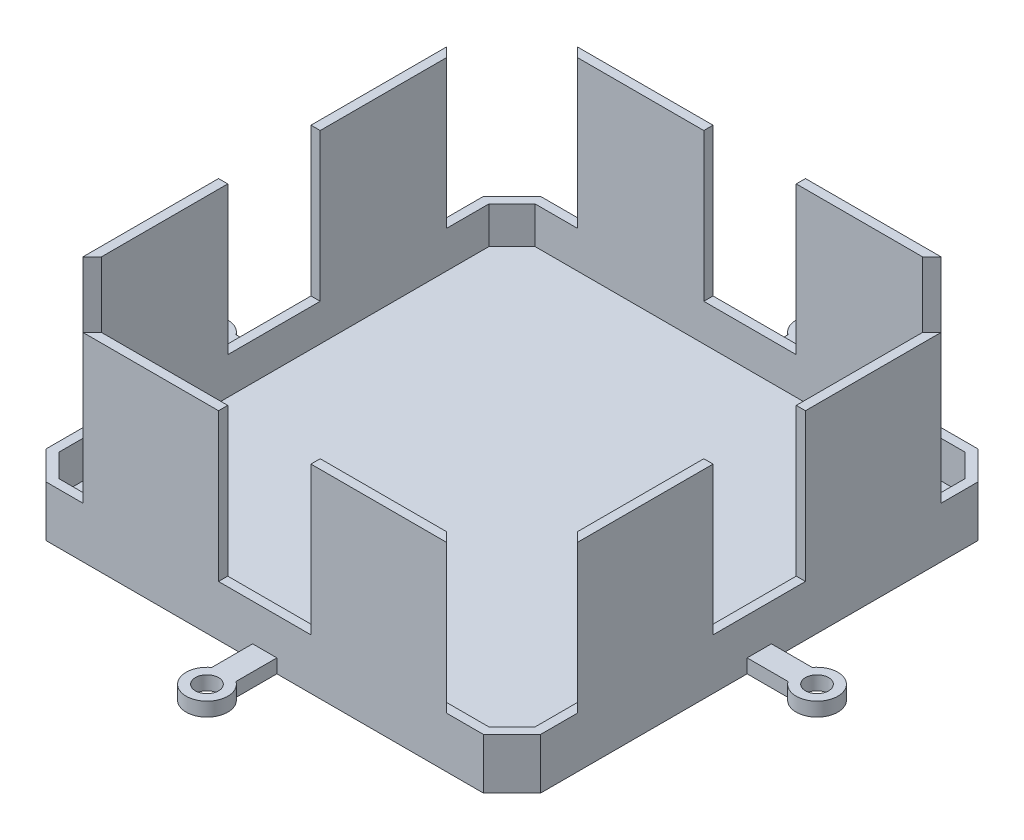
ISO-10303-21;
HEADER;
FILE_DESCRIPTION(('STEP AP214'),'2;1');
FILE_NAME('part.step','',(''),(''),'','','');
FILE_SCHEMA(('AUTOMOTIVE_DESIGN { 1 0 10303 214 1 1 1 1 }'));
ENDSEC;
DATA;
#1=APPLICATION_CONTEXT('core data for automotive mechanical design processes');
#2=APPLICATION_PROTOCOL_DEFINITION('international standard','automotive_design',2000,#1);
#3=PRODUCT_CONTEXT('',#1,'mechanical');
#4=PRODUCT('Part','Part','',(#3));
#5=PRODUCT_RELATED_PRODUCT_CATEGORY('part','',(#4));
#6=PRODUCT_DEFINITION_FORMATION('','',#4);
#7=PRODUCT_DEFINITION_CONTEXT('part definition',#1,'design');
#8=PRODUCT_DEFINITION('design','',#6,#7);
#9=PRODUCT_DEFINITION_SHAPE('','',#8);
#10=(LENGTH_UNIT() NAMED_UNIT(*) SI_UNIT(.MILLI.,.METRE.));
#11=(NAMED_UNIT(*) PLANE_ANGLE_UNIT() SI_UNIT($,.RADIAN.));
#12=(NAMED_UNIT(*) SI_UNIT($,.STERADIAN.) SOLID_ANGLE_UNIT());
#13=UNCERTAINTY_MEASURE_WITH_UNIT(LENGTH_MEASURE(1.E-05),#10,'distance_accuracy_value','');
#14=(GEOMETRIC_REPRESENTATION_CONTEXT(3) GLOBAL_UNCERTAINTY_ASSIGNED_CONTEXT((#13)) GLOBAL_UNIT_ASSIGNED_CONTEXT((#10,
#11,#12)) REPRESENTATION_CONTEXT('',''));
#15=CARTESIAN_POINT('',(0.,0.,0.));
#16=DIRECTION('',(0.,0.,1.));
#17=DIRECTION('',(1.,0.,0.));
#18=AXIS2_PLACEMENT_3D('',#15,#16,#17);
#19=CARTESIAN_POINT('',(0.,43.,0.));
#20=DIRECTION('',(0.,1.,0.));
#21=DIRECTION('',(0.,0.,1.));
#22=AXIS2_PLACEMENT_3D('',#19,#20,#21);
#23=PLANE('',#22);
#24=DIRECTION('',(0.707106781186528,0.,-0.707106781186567));
#25=VECTOR('',#24,1.);
#26=CARTESIAN_POINT('',(58.6898628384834,43.,-44.5477272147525));
#27=LINE('',#26,#25);
#28=CARTESIAN_POINT('',(51.5,43.,-37.3578643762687));
#29=VERTEX_POINT('',#28);
#30=CARTESIAN_POINT('',(53.5,43.,-39.3578643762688));
#31=VERTEX_POINT('',#30);
#32=EDGE_CURVE('E460',#29,#31,#27,.T.);
#33=ORIENTED_EDGE('',*,*,#32,.F.);
#34=DIRECTION('',(0.,0.,-1.));
#35=VECTOR('',#34,1.);
#36=CARTESIAN_POINT('',(51.5,43.,46.5));
#37=LINE('',#36,#35);
#38=CARTESIAN_POINT('',(51.5,43.,-10.));
#39=VERTEX_POINT('',#38);
#40=EDGE_CURVE('E599',#39,#29,#37,.T.);
#41=ORIENTED_EDGE('',*,*,#40,.F.);
#42=DIRECTION('',(-1.,0.,0.));
#43=VECTOR('',#42,1.);
#44=CARTESIAN_POINT('',(50.,43.,-10.));
#45=LINE('',#44,#43);
#46=CARTESIAN_POINT('',(53.5,43.,-10.));
#47=VERTEX_POINT('',#46);
#48=EDGE_CURVE('E933',#47,#39,#45,.T.);
#49=ORIENTED_EDGE('',*,*,#48,.F.);
#50=DIRECTION('',(0.,0.,-1.));
#51=VECTOR('',#50,1.);
#52=CARTESIAN_POINT('',(53.5,43.,47.3284271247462));
#53=LINE('',#52,#51);
#54=EDGE_CURVE('E474',#47,#31,#53,.T.);
#55=ORIENTED_EDGE('',*,*,#54,.T.);
#56=EDGE_LOOP('',(#33,#41,#49,#55));
#57=FACE_BOUND('',#56,.T.);
#58=ADVANCED_FACE('F39',(#57),#23,.T.);
#59=DIRECTION('',(-0.707106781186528,0.,0.707106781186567));
#60=VECTOR('',#59,1.);
#61=CARTESIAN_POINT('',(28.2842712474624,43.,-42.4264068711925));
#62=LINE('',#61,#60);
#63=CARTESIAN_POINT('',(39.3578643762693,43.,-53.5));
#64=VERTEX_POINT('',#63);
#65=CARTESIAN_POINT('',(37.3578643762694,43.,-51.5));
#66=VERTEX_POINT('',#65);
#67=EDGE_CURVE('E442',#64,#66,#62,.T.);
#68=ORIENTED_EDGE('',*,*,#67,.F.);
#69=DIRECTION('',(-1.,0.,0.));
#70=VECTOR('',#69,1.);
#71=CARTESIAN_POINT('',(-47.3284271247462,43.,-53.5));
#72=LINE('',#71,#70);
#73=CARTESIAN_POINT('',(10.0000000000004,43.,-53.5));
#74=VERTEX_POINT('',#73);
#75=EDGE_CURVE('E457',#64,#74,#72,.T.);
#76=ORIENTED_EDGE('',*,*,#75,.T.);
#77=DIRECTION('',(0.,0.,-1.));
#78=VECTOR('',#77,1.);
#79=CARTESIAN_POINT('',(9.99999999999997,43.,-73.));
#80=LINE('',#79,#78);
#81=CARTESIAN_POINT('',(10.0000000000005,43.,-51.5));
#82=VERTEX_POINT('',#81);
#83=EDGE_CURVE('E575',#82,#74,#80,.T.);
#84=ORIENTED_EDGE('',*,*,#83,.F.);
#85=DIRECTION('',(-1.,0.,0.));
#86=VECTOR('',#85,1.);
#87=CARTESIAN_POINT('',(-46.5,43.,-51.5));
#88=LINE('',#87,#86);
#89=EDGE_CURVE('E459',#66,#82,#88,.T.);
#90=ORIENTED_EDGE('',*,*,#89,.F.);
#91=EDGE_LOOP('',(#68,#76,#84,#90));
#92=FACE_BOUND('',#91,.T.);
#93=ADVANCED_FACE('F455',(#92),#23,.T.);
#94=DIRECTION('',(0.,0.,1.));
#95=VECTOR('',#94,1.);
#96=CARTESIAN_POINT('',(-9.99999999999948,43.,-50.0000000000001));
#97=LINE('',#96,#95);
#98=CARTESIAN_POINT('',(-9.99999999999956,43.,-53.5));
#99=VERTEX_POINT('',#98);
#100=CARTESIAN_POINT('',(-9.99999999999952,43.,-51.5));
#101=VERTEX_POINT('',#100);
#102=EDGE_CURVE('E580',#99,#101,#97,.T.);
#103=ORIENTED_EDGE('',*,*,#102,.F.);
#104=CARTESIAN_POINT('',(-39.3578643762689,43.,-53.5));
#105=VERTEX_POINT('',#104);
#106=EDGE_CURVE('E466',#99,#105,#72,.T.);
#107=ORIENTED_EDGE('',*,*,#106,.T.);
#108=DIRECTION('',(-0.707106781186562,0.,-0.707106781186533));
#109=VECTOR('',#108,1.);
#110=CARTESIAN_POINT('',(-44.5477272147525,43.,-58.6898628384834));
#111=LINE('',#110,#109);
#112=CARTESIAN_POINT('',(-37.3578643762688,43.,-51.5));
#113=VERTEX_POINT('',#112);
#114=EDGE_CURVE('E971',#113,#105,#111,.T.);
#115=ORIENTED_EDGE('',*,*,#114,.F.);
#116=EDGE_CURVE('E585',#101,#113,#88,.T.);
#117=ORIENTED_EDGE('',*,*,#116,.F.);
#118=EDGE_LOOP('',(#103,#107,#115,#117));
#119=FACE_BOUND('',#118,.T.);
#120=ADVANCED_FACE('F1048',(#119),#23,.T.);
#121=DIRECTION('',(0.707106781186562,0.,0.707106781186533));
#122=VECTOR('',#121,1.);
#123=CARTESIAN_POINT('',(-42.4264068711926,43.,-28.2842712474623));
#124=LINE('',#123,#122);
#125=CARTESIAN_POINT('',(-53.5,43.,-39.3578643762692));
#126=VERTEX_POINT('',#125);
#127=CARTESIAN_POINT('',(-51.5,43.,-37.3578643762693));
#128=VERTEX_POINT('',#127);
#129=EDGE_CURVE('E974',#126,#128,#124,.T.);
#130=ORIENTED_EDGE('',*,*,#129,.F.);
#131=DIRECTION('',(0.,0.,1.));
#132=VECTOR('',#131,1.);
#133=CARTESIAN_POINT('',(-53.5,43.,47.3284271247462));
#134=LINE('',#133,#132);
#135=CARTESIAN_POINT('',(-53.5,43.,-10.0000000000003));
#136=VERTEX_POINT('',#135);
#137=EDGE_CURVE('E469',#126,#136,#134,.T.);
#138=ORIENTED_EDGE('',*,*,#137,.T.);
#139=DIRECTION('',(-1.,0.,0.));
#140=VECTOR('',#139,1.);
#141=CARTESIAN_POINT('',(-73.,43.,-9.99999999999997));
#142=LINE('',#141,#140);
#143=CARTESIAN_POINT('',(-51.5,43.,-10.0000000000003));
#144=VERTEX_POINT('',#143);
#145=EDGE_CURVE('E963',#144,#136,#142,.T.);
#146=ORIENTED_EDGE('',*,*,#145,.F.);
#147=DIRECTION('',(0.,0.,1.));
#148=VECTOR('',#147,1.);
#149=CARTESIAN_POINT('',(-51.5,43.,46.5));
#150=LINE('',#149,#148);
#151=EDGE_CURVE('E588',#128,#144,#150,.T.);
#152=ORIENTED_EDGE('',*,*,#151,.F.);
#153=EDGE_LOOP('',(#130,#138,#146,#152));
#154=FACE_BOUND('',#153,.T.);
#155=ADVANCED_FACE('F1349',(#154),#23,.T.);
#156=DIRECTION('',(1.,0.,0.));
#157=VECTOR('',#156,1.);
#158=CARTESIAN_POINT('',(-50.0000000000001,43.,9.99999999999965));
#159=LINE('',#158,#157);
#160=CARTESIAN_POINT('',(-53.5,43.,9.99999999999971));
#161=VERTEX_POINT('',#160);
#162=CARTESIAN_POINT('',(-51.5,43.,9.99999999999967));
#163=VERTEX_POINT('',#162);
#164=EDGE_CURVE('E966',#161,#163,#159,.T.);
#165=ORIENTED_EDGE('',*,*,#164,.F.);
#166=CARTESIAN_POINT('',(-53.5,43.,39.3578643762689));
#167=VERTEX_POINT('',#166);
#168=EDGE_CURVE('E465',#161,#167,#134,.T.);
#169=ORIENTED_EDGE('',*,*,#168,.T.);
#170=DIRECTION('',(-0.707106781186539,0.,0.707106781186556));
#171=VECTOR('',#170,1.);
#172=CARTESIAN_POINT('',(-58.6898628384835,43.,44.5477272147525));
#173=LINE('',#172,#171);
#174=CARTESIAN_POINT('',(-51.5,43.,37.3578643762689));
#175=VERTEX_POINT('',#174);
#176=EDGE_CURVE('E954',#175,#167,#173,.T.);
#177=ORIENTED_EDGE('',*,*,#176,.F.);
#178=EDGE_CURVE('E584',#163,#175,#150,.T.);
#179=ORIENTED_EDGE('',*,*,#178,.F.);
#180=EDGE_LOOP('',(#165,#169,#177,#179));
#181=FACE_BOUND('',#180,.T.);
#182=ADVANCED_FACE('F1083',(#181),#23,.T.);
#183=DIRECTION('',(0.707106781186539,0.,-0.707106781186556));
#184=VECTOR('',#183,1.);
#185=CARTESIAN_POINT('',(-28.2842712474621,43.,42.4264068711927));
#186=LINE('',#185,#184);
#187=CARTESIAN_POINT('',(-39.3578643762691,43.,53.5));
#188=VERTEX_POINT('',#187);
#189=CARTESIAN_POINT('',(-37.3578643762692,43.,51.5));
#190=VERTEX_POINT('',#189);
#191=EDGE_CURVE('E957',#188,#190,#186,.T.);
#192=ORIENTED_EDGE('',*,*,#191,.F.);
#193=DIRECTION('',(1.,0.,0.));
#194=VECTOR('',#193,1.);
#195=CARTESIAN_POINT('',(-47.3284271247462,43.,53.5));
#196=LINE('',#195,#194);
#197=CARTESIAN_POINT('',(-10.0000000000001,43.,53.5));
#198=VERTEX_POINT('',#197);
#199=EDGE_CURVE('E618',#188,#198,#196,.T.);
#200=ORIENTED_EDGE('',*,*,#199,.T.);
#201=DIRECTION('',(0.,0.,1.));
#202=VECTOR('',#201,1.);
#203=CARTESIAN_POINT('',(-9.99999999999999,43.,73.));
#204=LINE('',#203,#202);
#205=CARTESIAN_POINT('',(-10.0000000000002,43.,51.5));
#206=VERTEX_POINT('',#205);
#207=EDGE_CURVE('E945',#206,#198,#204,.T.);
#208=ORIENTED_EDGE('',*,*,#207,.F.);
#209=DIRECTION('',(1.,0.,0.));
#210=VECTOR('',#209,1.);
#211=CARTESIAN_POINT('',(-46.5,43.,51.5));
#212=LINE('',#211,#210);
#213=EDGE_CURVE('E598',#190,#206,#212,.T.);
#214=ORIENTED_EDGE('',*,*,#213,.F.);
#215=EDGE_LOOP('',(#192,#200,#208,#214));
#216=FACE_BOUND('',#215,.T.);
#217=ADVANCED_FACE('F1076',(#216),#23,.T.);
#218=DIRECTION('',(0.,0.,-1.));
#219=VECTOR('',#218,1.);
#220=CARTESIAN_POINT('',(9.99999999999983,43.,50.));
#221=LINE('',#220,#219);
#222=CARTESIAN_POINT('',(9.99999999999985,43.,53.5));
#223=VERTEX_POINT('',#222);
#224=CARTESIAN_POINT('',(9.99999999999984,43.,51.5));
#225=VERTEX_POINT('',#224);
#226=EDGE_CURVE('E948',#223,#225,#221,.T.);
#227=ORIENTED_EDGE('',*,*,#226,.F.);
#228=CARTESIAN_POINT('',(39.357864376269,43.,53.5));
#229=VERTEX_POINT('',#228);
#230=EDGE_CURVE('E506',#223,#229,#196,.T.);
#231=ORIENTED_EDGE('',*,*,#230,.T.);
#232=DIRECTION('',(0.70710678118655,0.,0.707106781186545));
#233=VECTOR('',#232,1.);
#234=CARTESIAN_POINT('',(44.5477272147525,43.,58.6898628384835));
#235=LINE('',#234,#233);
#236=CARTESIAN_POINT('',(37.357864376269,43.,51.5));
#237=VERTEX_POINT('',#236);
#238=EDGE_CURVE('E937',#237,#229,#235,.T.);
#239=ORIENTED_EDGE('',*,*,#238,.F.);
#240=EDGE_CURVE('E595',#225,#237,#212,.T.);
#241=ORIENTED_EDGE('',*,*,#240,.F.);
#242=EDGE_LOOP('',(#227,#231,#239,#241));
#243=FACE_BOUND('',#242,.T.);
#244=ADVANCED_FACE('F1068',(#243),#23,.T.);
#245=CARTESIAN_POINT('',(-47.3284271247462,43.,53.5));
#246=DIRECTION('',(0.,0.,-1.));
#247=DIRECTION('',(-1.,0.,0.));
#248=AXIS2_PLACEMENT_3D('',#245,#246,#247);
#249=PLANE('',#248);
#250=ORIENTED_EDGE('',*,*,#199,.F.);
#251=DIRECTION('',(0.,-1.,0.));
#252=VECTOR('',#251,1.);
#253=CARTESIAN_POINT('',(-39.3578643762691,43.,53.5));
#254=LINE('',#253,#252);
#255=CARTESIAN_POINT('',(-39.3578643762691,11.,53.5));
#256=VERTEX_POINT('',#255);
#257=EDGE_CURVE('E703',#188,#256,#254,.T.);
#258=ORIENTED_EDGE('',*,*,#257,.T.);
#259=DIRECTION('',(-1.,0.,0.));
#260=VECTOR('',#259,1.);
#261=CARTESIAN_POINT('',(-47.3284271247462,11.,53.5));
#262=LINE('',#261,#260);
#263=CARTESIAN_POINT('',(-47.3284271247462,11.,53.5));
#264=VERTEX_POINT('',#263);
#265=EDGE_CURVE('E700',#256,#264,#262,.T.);
#266=ORIENTED_EDGE('',*,*,#265,.T.);
#267=DIRECTION('',(0.,-1.,0.));
#268=VECTOR('',#267,1.);
#269=CARTESIAN_POINT('',(-47.3284271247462,43.,53.5));
#270=LINE('',#269,#268);
#271=CARTESIAN_POINT('',(-47.3284271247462,0.,53.5));
#272=VERTEX_POINT('',#271);
#273=EDGE_CURVE('E521',#264,#272,#270,.T.);
#274=ORIENTED_EDGE('',*,*,#273,.T.);
#275=DIRECTION('',(1.,0.,0.));
#276=VECTOR('',#275,1.);
#277=CARTESIAN_POINT('',(-47.3284271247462,0.,53.5));
#278=LINE('',#277,#276);
#279=CARTESIAN_POINT('',(-2.62499999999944,0.,53.5));
#280=VERTEX_POINT('',#279);
#281=EDGE_CURVE('E482',#272,#280,#278,.T.);
#282=ORIENTED_EDGE('',*,*,#281,.T.);
#283=DIRECTION('',(0.,-1.,0.));
#284=VECTOR('',#283,1.);
#285=CARTESIAN_POINT('',(-2.62499999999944,3.,53.5));
#286=LINE('',#285,#284);
#287=CARTESIAN_POINT('',(-2.62499999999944,3.,53.5));
#288=VERTEX_POINT('',#287);
#289=EDGE_CURVE('E762',#288,#280,#286,.T.);
#290=ORIENTED_EDGE('',*,*,#289,.F.);
#291=DIRECTION('',(1.,0.,0.));
#292=VECTOR('',#291,1.);
#293=CARTESIAN_POINT('',(-2.62499999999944,3.,53.5));
#294=LINE('',#293,#292);
#295=CARTESIAN_POINT('',(2.62500000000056,3.,53.5));
#296=VERTEX_POINT('',#295);
#297=EDGE_CURVE('E752',#288,#296,#294,.T.);
#298=ORIENTED_EDGE('',*,*,#297,.T.);
#299=DIRECTION('',(0.,-1.,0.));
#300=VECTOR('',#299,1.);
#301=CARTESIAN_POINT('',(2.62500000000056,3.,53.5));
#302=LINE('',#301,#300);
#303=CARTESIAN_POINT('',(2.62500000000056,0.,53.5));
#304=VERTEX_POINT('',#303);
#305=EDGE_CURVE('E775',#296,#304,#302,.T.);
#306=ORIENTED_EDGE('',*,*,#305,.T.);
#307=CARTESIAN_POINT('',(47.3284271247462,0.,53.5));
#308=VERTEX_POINT('',#307);
#309=EDGE_CURVE('E480',#304,#308,#278,.T.);
#310=ORIENTED_EDGE('',*,*,#309,.T.);
#311=DIRECTION('',(0.,-1.,0.));
#312=VECTOR('',#311,1.);
#313=CARTESIAN_POINT('',(47.3284271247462,43.,53.5));
#314=LINE('',#313,#312);
#315=CARTESIAN_POINT('',(47.3284271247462,11.,53.5));
#316=VERTEX_POINT('',#315);
#317=EDGE_CURVE('E519',#316,#308,#314,.T.);
#318=ORIENTED_EDGE('',*,*,#317,.F.);
#319=DIRECTION('',(-1.,0.,0.));
#320=VECTOR('',#319,1.);
#321=CARTESIAN_POINT('',(-47.3284271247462,11.,53.5));
#322=LINE('',#321,#320);
#323=CARTESIAN_POINT('',(39.357864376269,11.,53.5));
#324=VERTEX_POINT('',#323);
#325=EDGE_CURVE('E671',#316,#324,#322,.T.);
#326=ORIENTED_EDGE('',*,*,#325,.T.);
#327=DIRECTION('',(0.,1.,0.));
#328=VECTOR('',#327,1.);
#329=CARTESIAN_POINT('',(39.357864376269,43.,53.5));
#330=LINE('',#329,#328);
#331=EDGE_CURVE('E678',#324,#229,#330,.T.);
#332=ORIENTED_EDGE('',*,*,#331,.T.);
#333=ORIENTED_EDGE('',*,*,#230,.F.);
#334=DIRECTION('',(0.,-1.,0.));
#335=VECTOR('',#334,1.);
#336=CARTESIAN_POINT('',(9.99999999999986,43.,53.5));
#337=LINE('',#336,#335);
#338=CARTESIAN_POINT('',(9.99999999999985,11.,53.5));
#339=VERTEX_POINT('',#338);
#340=EDGE_CURVE('E684',#223,#339,#337,.T.);
#341=ORIENTED_EDGE('',*,*,#340,.T.);
#342=DIRECTION('',(-1.,0.,0.));
#343=VECTOR('',#342,1.);
#344=CARTESIAN_POINT('',(-47.3284271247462,11.,53.5));
#345=LINE('',#344,#343);
#346=CARTESIAN_POINT('',(-10.0000000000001,11.,53.5));
#347=VERTEX_POINT('',#346);
#348=EDGE_CURVE('E681',#339,#347,#345,.T.);
#349=ORIENTED_EDGE('',*,*,#348,.T.);
#350=DIRECTION('',(0.,1.,0.));
#351=VECTOR('',#350,1.);
#352=CARTESIAN_POINT('',(-10.0000000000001,43.,53.5));
#353=LINE('',#352,#351);
#354=EDGE_CURVE('E687',#347,#198,#353,.T.);
#355=ORIENTED_EDGE('',*,*,#354,.T.);
#356=EDGE_LOOP('',(#250,#258,#266,#274,#282,#290,#298,#306,#310,#318,#326,#332,#333,#341,#349,#355));
#357=FACE_BOUND('',#356,.T.);
#358=ADVANCED_FACE('F1075',(#357),#249,.F.);
#359=CARTESIAN_POINT('',(-53.5,43.,47.3284271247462));
#360=DIRECTION('',(1.,0.,0.));
#361=DIRECTION('',(0.,0.,-1.));
#362=AXIS2_PLACEMENT_3D('',#359,#360,#361);
#363=PLANE('',#362);
#364=ORIENTED_EDGE('',*,*,#137,.F.);
#365=DIRECTION('',(0.,-1.,0.));
#366=VECTOR('',#365,1.);
#367=CARTESIAN_POINT('',(-53.5,43.,-39.3578643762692));
#368=LINE('',#367,#366);
#369=CARTESIAN_POINT('',(-53.5,11.,-39.3578643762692));
#370=VERTEX_POINT('',#369);
#371=EDGE_CURVE('E731',#126,#370,#368,.T.);
#372=ORIENTED_EDGE('',*,*,#371,.T.);
#373=DIRECTION('',(0.,0.,-1.));
#374=VECTOR('',#373,1.);
#375=CARTESIAN_POINT('',(-53.5,11.,47.3284271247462));
#376=LINE('',#375,#374);
#377=CARTESIAN_POINT('',(-53.5,11.,-47.3284271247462));
#378=VERTEX_POINT('',#377);
#379=EDGE_CURVE('E728',#370,#378,#376,.T.);
#380=ORIENTED_EDGE('',*,*,#379,.T.);
#381=DIRECTION('',(0.,-1.,0.));
#382=VECTOR('',#381,1.);
#383=CARTESIAN_POINT('',(-53.5,43.,-47.3284271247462));
#384=LINE('',#383,#382);
#385=CARTESIAN_POINT('',(-53.5,0.,-47.3284271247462));
#386=VERTEX_POINT('',#385);
#387=EDGE_CURVE('E509',#378,#386,#384,.T.);
#388=ORIENTED_EDGE('',*,*,#387,.T.);
#389=DIRECTION('',(0.,0.,1.));
#390=VECTOR('',#389,1.);
#391=CARTESIAN_POINT('',(-53.5,0.,47.3284271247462));
#392=LINE('',#391,#390);
#393=CARTESIAN_POINT('',(-53.5,0.,-2.62499999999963));
#394=VERTEX_POINT('',#393);
#395=EDGE_CURVE('E503',#386,#394,#392,.T.);
#396=ORIENTED_EDGE('',*,*,#395,.T.);
#397=DIRECTION('',(0.,-1.,0.));
#398=VECTOR('',#397,1.);
#399=CARTESIAN_POINT('',(-53.5,3.,-2.62499999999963));
#400=LINE('',#399,#398);
#401=CARTESIAN_POINT('',(-53.5,3.,-2.62499999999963));
#402=VERTEX_POINT('',#401);
#403=EDGE_CURVE('E798',#402,#394,#400,.T.);
#404=ORIENTED_EDGE('',*,*,#403,.F.);
#405=DIRECTION('',(0.,0.,1.));
#406=VECTOR('',#405,1.);
#407=CARTESIAN_POINT('',(-53.5,3.,-2.62499999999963));
#408=LINE('',#407,#406);
#409=CARTESIAN_POINT('',(-53.5,3.,2.62500000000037));
#410=VERTEX_POINT('',#409);
#411=EDGE_CURVE('E788',#402,#410,#408,.T.);
#412=ORIENTED_EDGE('',*,*,#411,.T.);
#413=DIRECTION('',(0.,-1.,0.));
#414=VECTOR('',#413,1.);
#415=CARTESIAN_POINT('',(-53.5,3.,2.62500000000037));
#416=LINE('',#415,#414);
#417=CARTESIAN_POINT('',(-53.5,0.,2.62500000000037));
#418=VERTEX_POINT('',#417);
#419=EDGE_CURVE('E811',#410,#418,#416,.T.);
#420=ORIENTED_EDGE('',*,*,#419,.T.);
#421=CARTESIAN_POINT('',(-53.5,0.,47.3284271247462));
#422=VERTEX_POINT('',#421);
#423=EDGE_CURVE('E502',#418,#422,#392,.T.);
#424=ORIENTED_EDGE('',*,*,#423,.T.);
#425=DIRECTION('',(0.,-1.,0.));
#426=VECTOR('',#425,1.);
#427=CARTESIAN_POINT('',(-53.5,43.,47.3284271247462));
#428=LINE('',#427,#426);
#429=CARTESIAN_POINT('',(-53.5,11.,47.3284271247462));
#430=VERTEX_POINT('',#429);
#431=EDGE_CURVE('E507',#430,#422,#428,.T.);
#432=ORIENTED_EDGE('',*,*,#431,.F.);
#433=DIRECTION('',(0.,0.,-1.));
#434=VECTOR('',#433,1.);
#435=CARTESIAN_POINT('',(-53.5,11.,47.3284271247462));
#436=LINE('',#435,#434);
#437=CARTESIAN_POINT('',(-53.5,11.,39.3578643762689));
#438=VERTEX_POINT('',#437);
#439=EDGE_CURVE('E697',#430,#438,#436,.T.);
#440=ORIENTED_EDGE('',*,*,#439,.T.);
#441=DIRECTION('',(0.,1.,0.));
#442=VECTOR('',#441,1.);
#443=CARTESIAN_POINT('',(-53.5,43.,39.3578643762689));
#444=LINE('',#443,#442);
#445=EDGE_CURVE('E706',#438,#167,#444,.T.);
#446=ORIENTED_EDGE('',*,*,#445,.T.);
#447=ORIENTED_EDGE('',*,*,#168,.F.);
#448=DIRECTION('',(0.,-1.,0.));
#449=VECTOR('',#448,1.);
#450=CARTESIAN_POINT('',(-53.5,43.,9.9999999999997));
#451=LINE('',#450,#449);
#452=CARTESIAN_POINT('',(-53.5,11.,9.99999999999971));
#453=VERTEX_POINT('',#452);
#454=EDGE_CURVE('E712',#161,#453,#451,.T.);
#455=ORIENTED_EDGE('',*,*,#454,.T.);
#456=DIRECTION('',(0.,0.,-1.));
#457=VECTOR('',#456,1.);
#458=CARTESIAN_POINT('',(-53.5,11.,47.3284271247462));
#459=LINE('',#458,#457);
#460=CARTESIAN_POINT('',(-53.5,11.,-10.0000000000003));
#461=VERTEX_POINT('',#460);
#462=EDGE_CURVE('E709',#453,#461,#459,.T.);
#463=ORIENTED_EDGE('',*,*,#462,.T.);
#464=DIRECTION('',(0.,1.,0.));
#465=VECTOR('',#464,1.);
#466=CARTESIAN_POINT('',(-53.5,43.,-10.0000000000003));
#467=LINE('',#466,#465);
#468=EDGE_CURVE('E715',#461,#136,#467,.T.);
#469=ORIENTED_EDGE('',*,*,#468,.T.);
#470=EDGE_LOOP('',(#364,#372,#380,#388,#396,#404,#412,#420,#424,#432,#440,#446,#447,#455,#463,#469));
#471=FACE_BOUND('',#470,.T.);
#472=ADVANCED_FACE('F1081',(#471),#363,.F.);
#473=CARTESIAN_POINT('',(-47.3284271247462,43.,-53.5));
#474=DIRECTION('',(0.,0.,1.));
#475=DIRECTION('',(1.,0.,0.));
#476=AXIS2_PLACEMENT_3D('',#473,#474,#475);
#477=PLANE('',#476);
#478=ORIENTED_EDGE('',*,*,#75,.F.);
#479=DIRECTION('',(0.,-1.,0.));
#480=VECTOR('',#479,1.);
#481=CARTESIAN_POINT('',(39.3578643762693,43.,-53.5));
#482=LINE('',#481,#480);
#483=CARTESIAN_POINT('',(39.3578643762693,11.,-53.5));
#484=VERTEX_POINT('',#483);
#485=EDGE_CURVE('E439',#64,#484,#482,.T.);
#486=ORIENTED_EDGE('',*,*,#485,.T.);
#487=DIRECTION('',(1.,0.,0.));
#488=VECTOR('',#487,1.);
#489=CARTESIAN_POINT('',(-47.3284271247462,11.,-53.5));
#490=LINE('',#489,#488);
#491=CARTESIAN_POINT('',(47.3284271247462,11.,-53.5));
#492=VERTEX_POINT('',#491);
#493=EDGE_CURVE('E999',#484,#492,#490,.T.);
#494=ORIENTED_EDGE('',*,*,#493,.T.);
#495=DIRECTION('',(0.,-1.,0.));
#496=VECTOR('',#495,1.);
#497=CARTESIAN_POINT('',(47.3284271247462,43.,-53.5));
#498=LINE('',#497,#496);
#499=CARTESIAN_POINT('',(47.3284271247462,0.,-53.5));
#500=VERTEX_POINT('',#499);
#501=EDGE_CURVE('E513',#492,#500,#498,.T.);
#502=ORIENTED_EDGE('',*,*,#501,.T.);
#503=DIRECTION('',(-1.,0.,0.));
#504=VECTOR('',#503,1.);
#505=CARTESIAN_POINT('',(-47.3284271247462,0.,-53.5));
#506=LINE('',#505,#504);
#507=CARTESIAN_POINT('',(2.62499999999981,0.,-53.5));
#508=VERTEX_POINT('',#507);
#509=EDGE_CURVE('E496',#500,#508,#506,.T.);
#510=ORIENTED_EDGE('',*,*,#509,.T.);
#511=DIRECTION('',(0.,-1.,0.));
#512=VECTOR('',#511,1.);
#513=CARTESIAN_POINT('',(2.62499999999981,3.,-53.5));
#514=LINE('',#513,#512);
#515=CARTESIAN_POINT('',(2.62499999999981,3.,-53.5));
#516=VERTEX_POINT('',#515);
#517=EDGE_CURVE('E834',#516,#508,#514,.T.);
#518=ORIENTED_EDGE('',*,*,#517,.F.);
#519=DIRECTION('',(-1.,0.,0.));
#520=VECTOR('',#519,1.);
#521=CARTESIAN_POINT('',(2.62499999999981,3.,-53.5));
#522=LINE('',#521,#520);
#523=CARTESIAN_POINT('',(-2.62500000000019,3.,-53.5));
#524=VERTEX_POINT('',#523);
#525=EDGE_CURVE('E824',#516,#524,#522,.T.);
#526=ORIENTED_EDGE('',*,*,#525,.T.);
#527=DIRECTION('',(0.,-1.,0.));
#528=VECTOR('',#527,1.);
#529=CARTESIAN_POINT('',(-2.62500000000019,3.,-53.5));
#530=LINE('',#529,#528);
#531=CARTESIAN_POINT('',(-2.62500000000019,0.,-53.5));
#532=VERTEX_POINT('',#531);
#533=EDGE_CURVE('E847',#524,#532,#530,.T.);
#534=ORIENTED_EDGE('',*,*,#533,.T.);
#535=CARTESIAN_POINT('',(-47.3284271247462,0.,-53.5));
#536=VERTEX_POINT('',#535);
#537=EDGE_CURVE('E495',#532,#536,#506,.T.);
#538=ORIENTED_EDGE('',*,*,#537,.T.);
#539=DIRECTION('',(0.,-1.,0.));
#540=VECTOR('',#539,1.);
#541=CARTESIAN_POINT('',(-47.3284271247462,43.,-53.5));
#542=LINE('',#541,#540);
#543=CARTESIAN_POINT('',(-47.3284271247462,11.,-53.5));
#544=VERTEX_POINT('',#543);
#545=EDGE_CURVE('E511',#544,#536,#542,.T.);
#546=ORIENTED_EDGE('',*,*,#545,.F.);
#547=DIRECTION('',(1.,0.,0.));
#548=VECTOR('',#547,1.);
#549=CARTESIAN_POINT('',(-47.3284271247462,11.,-53.5));
#550=LINE('',#549,#548);
#551=CARTESIAN_POINT('',(-39.3578643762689,11.,-53.5));
#552=VERTEX_POINT('',#551);
#553=EDGE_CURVE('E725',#544,#552,#550,.T.);
#554=ORIENTED_EDGE('',*,*,#553,.T.);
#555=DIRECTION('',(0.,1.,0.));
#556=VECTOR('',#555,1.);
#557=CARTESIAN_POINT('',(-39.3578643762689,43.,-53.5));
#558=LINE('',#557,#556);
#559=EDGE_CURVE('E734',#552,#105,#558,.T.);
#560=ORIENTED_EDGE('',*,*,#559,.T.);
#561=ORIENTED_EDGE('',*,*,#106,.F.);
#562=DIRECTION('',(0.,-1.,0.));
#563=VECTOR('',#562,1.);
#564=CARTESIAN_POINT('',(-9.99999999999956,43.,-53.5));
#565=LINE('',#564,#563);
#566=CARTESIAN_POINT('',(-9.99999999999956,11.,-53.5));
#567=VERTEX_POINT('',#566);
#568=EDGE_CURVE('E739',#99,#567,#565,.T.);
#569=ORIENTED_EDGE('',*,*,#568,.T.);
#570=DIRECTION('',(1.,0.,0.));
#571=VECTOR('',#570,1.);
#572=CARTESIAN_POINT('',(-47.3284271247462,11.,-53.5));
#573=LINE('',#572,#571);
#574=CARTESIAN_POINT('',(10.0000000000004,11.,-53.5));
#575=VERTEX_POINT('',#574);
#576=EDGE_CURVE('E737',#567,#575,#573,.T.);
#577=ORIENTED_EDGE('',*,*,#576,.T.);
#578=DIRECTION('',(0.,1.,0.));
#579=VECTOR('',#578,1.);
#580=CARTESIAN_POINT('',(10.0000000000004,43.,-53.5));
#581=LINE('',#580,#579);
#582=EDGE_CURVE('E450',#575,#74,#581,.T.);
#583=ORIENTED_EDGE('',*,*,#582,.T.);
#584=EDGE_LOOP('',(#478,#486,#494,#502,#510,#518,#526,#534,#538,#546,#554,#560,#561,#569,#577,#583));
#585=FACE_BOUND('',#584,.T.);
#586=ADVANCED_FACE('F463',(#585),#477,.F.);
#587=CARTESIAN_POINT('',(53.5,43.,47.3284271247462));
#588=DIRECTION('',(-1.,0.,0.));
#589=DIRECTION('',(0.,0.,1.));
#590=AXIS2_PLACEMENT_3D('',#587,#588,#589);
#591=PLANE('',#590);
#592=DIRECTION('',(0.,0.,1.));
#593=VECTOR('',#592,1.);
#594=CARTESIAN_POINT('',(53.5,11.,47.3284271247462));
#595=LINE('',#594,#593);
#596=CARTESIAN_POINT('',(53.5,11.,-47.3284271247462));
#597=VERTEX_POINT('',#596);
#598=CARTESIAN_POINT('',(53.5,11.,-39.3578643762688));
#599=VERTEX_POINT('',#598);
#600=EDGE_CURVE('E997',#597,#599,#595,.T.);
#601=ORIENTED_EDGE('',*,*,#600,.T.);
#602=DIRECTION('',(0.,1.,0.));
#603=VECTOR('',#602,1.);
#604=CARTESIAN_POINT('',(53.5,43.,-39.3578643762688));
#605=LINE('',#604,#603);
#606=EDGE_CURVE('E675',#599,#31,#605,.T.);
#607=ORIENTED_EDGE('',*,*,#606,.T.);
#608=ORIENTED_EDGE('',*,*,#54,.F.);
#609=DIRECTION('',(0.,-1.,0.));
#610=VECTOR('',#609,1.);
#611=CARTESIAN_POINT('',(53.5,43.,-10.));
#612=LINE('',#611,#610);
#613=CARTESIAN_POINT('',(53.5,11.,-10.));
#614=VERTEX_POINT('',#613);
#615=EDGE_CURVE('E658',#47,#614,#612,.T.);
#616=ORIENTED_EDGE('',*,*,#615,.T.);
#617=DIRECTION('',(0.,0.,1.));
#618=VECTOR('',#617,1.);
#619=CARTESIAN_POINT('',(53.5,11.,47.3284271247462));
#620=LINE('',#619,#618);
#621=CARTESIAN_POINT('',(53.5,11.,10.));
#622=VERTEX_POINT('',#621);
#623=EDGE_CURVE('E653',#614,#622,#620,.T.);
#624=ORIENTED_EDGE('',*,*,#623,.T.);
#625=DIRECTION('',(0.,1.,0.));
#626=VECTOR('',#625,1.);
#627=CARTESIAN_POINT('',(53.5,43.,10.));
#628=LINE('',#627,#626);
#629=CARTESIAN_POINT('',(53.5,43.,10.));
#630=VERTEX_POINT('',#629);
#631=EDGE_CURVE('E651',#622,#630,#628,.T.);
#632=ORIENTED_EDGE('',*,*,#631,.T.);
#633=CARTESIAN_POINT('',(53.5,43.,39.3578643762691));
#634=VERTEX_POINT('',#633);
#635=EDGE_CURVE('E472',#634,#630,#53,.T.);
#636=ORIENTED_EDGE('',*,*,#635,.F.);
#637=DIRECTION('',(0.,-1.,0.));
#638=VECTOR('',#637,1.);
#639=CARTESIAN_POINT('',(53.5,43.,39.3578643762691));
#640=LINE('',#639,#638);
#641=CARTESIAN_POINT('',(53.5,11.,39.3578643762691));
#642=VERTEX_POINT('',#641);
#643=EDGE_CURVE('E649',#634,#642,#640,.T.);
#644=ORIENTED_EDGE('',*,*,#643,.T.);
#645=DIRECTION('',(0.,0.,1.));
#646=VECTOR('',#645,1.);
#647=CARTESIAN_POINT('',(53.5,11.,47.3284271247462));
#648=LINE('',#647,#646);
#649=CARTESIAN_POINT('',(53.5,11.,47.3284271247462));
#650=VERTEX_POINT('',#649);
#651=EDGE_CURVE('E669',#642,#650,#648,.T.);
#652=ORIENTED_EDGE('',*,*,#651,.T.);
#653=DIRECTION('',(0.,-1.,0.));
#654=VECTOR('',#653,1.);
#655=CARTESIAN_POINT('',(53.5,43.,47.3284271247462));
#656=LINE('',#655,#654);
#657=CARTESIAN_POINT('',(53.5,0.,47.3284271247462));
#658=VERTEX_POINT('',#657);
#659=EDGE_CURVE('E517',#650,#658,#656,.T.);
#660=ORIENTED_EDGE('',*,*,#659,.T.);
#661=DIRECTION('',(0.,0.,-1.));
#662=VECTOR('',#661,1.);
#663=CARTESIAN_POINT('',(53.5,0.,47.3284271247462));
#664=LINE('',#663,#662);
#665=CARTESIAN_POINT('',(53.5,0.,2.625));
#666=VERTEX_POINT('',#665);
#667=EDGE_CURVE('E489',#658,#666,#664,.T.);
#668=ORIENTED_EDGE('',*,*,#667,.T.);
#669=DIRECTION('',(0.,-1.,0.));
#670=VECTOR('',#669,1.);
#671=CARTESIAN_POINT('',(53.5,3.,2.625));
#672=LINE('',#671,#670);
#673=CARTESIAN_POINT('',(53.5,3.,2.625));
#674=VERTEX_POINT('',#673);
#675=EDGE_CURVE('E870',#674,#666,#672,.T.);
#676=ORIENTED_EDGE('',*,*,#675,.F.);
#677=DIRECTION('',(0.,0.,-1.));
#678=VECTOR('',#677,1.);
#679=CARTESIAN_POINT('',(53.5,3.,2.625));
#680=LINE('',#679,#678);
#681=CARTESIAN_POINT('',(53.5,3.,-2.625));
#682=VERTEX_POINT('',#681);
#683=EDGE_CURVE('E860',#674,#682,#680,.T.);
#684=ORIENTED_EDGE('',*,*,#683,.T.);
#685=DIRECTION('',(0.,-1.,0.));
#686=VECTOR('',#685,1.);
#687=CARTESIAN_POINT('',(53.5,3.,-2.625));
#688=LINE('',#687,#686);
#689=CARTESIAN_POINT('',(53.5,0.,-2.625));
#690=VERTEX_POINT('',#689);
#691=EDGE_CURVE('E883',#682,#690,#688,.T.);
#692=ORIENTED_EDGE('',*,*,#691,.T.);
#693=CARTESIAN_POINT('',(53.5,0.,-47.3284271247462));
#694=VERTEX_POINT('',#693);
#695=EDGE_CURVE('E488',#690,#694,#664,.T.);
#696=ORIENTED_EDGE('',*,*,#695,.T.);
#697=DIRECTION('',(0.,-1.,0.));
#698=VECTOR('',#697,1.);
#699=CARTESIAN_POINT('',(53.5,43.,-47.3284271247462));
#700=LINE('',#699,#698);
#701=EDGE_CURVE('E515',#597,#694,#700,.T.);
#702=ORIENTED_EDGE('',*,*,#701,.F.);
#703=EDGE_LOOP('',(#601,#607,#608,#616,#624,#632,#636,#644,#652,#660,#668,#676,#684,#692,#696,#702));
#704=FACE_BOUND('',#703,.T.);
#705=ADVANCED_FACE('F647',(#704),#591,.F.);
#706=DIRECTION('',(-0.70710678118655,0.,-0.707106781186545));
#707=VECTOR('',#706,1.);
#708=CARTESIAN_POINT('',(42.4264068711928,43.,28.284271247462));
#709=LINE('',#708,#707);
#710=CARTESIAN_POINT('',(51.5,43.,37.3578643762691));
#711=VERTEX_POINT('',#710);
#712=EDGE_CURVE('E642',#634,#711,#709,.T.);
#713=ORIENTED_EDGE('',*,*,#712,.F.);
#714=ORIENTED_EDGE('',*,*,#635,.T.);
#715=DIRECTION('',(1.,0.,0.));
#716=VECTOR('',#715,1.);
#717=CARTESIAN_POINT('',(73.,43.,10.));
#718=LINE('',#717,#716);
#719=CARTESIAN_POINT('',(51.5,43.,10.));
#720=VERTEX_POINT('',#719);
#721=EDGE_CURVE('E640',#720,#630,#718,.T.);
#722=ORIENTED_EDGE('',*,*,#721,.F.);
#723=EDGE_CURVE('E602',#711,#720,#37,.T.);
#724=ORIENTED_EDGE('',*,*,#723,.F.);
#725=EDGE_LOOP('',(#713,#714,#722,#724));
#726=FACE_BOUND('',#725,.T.);
#727=ADVANCED_FACE('F638',(#726),#23,.T.);
#728=CARTESIAN_POINT('',(0.,0.,0.));
#729=DIRECTION('',(0.,1.,0.));
#730=DIRECTION('',(0.,0.,1.));
#731=AXIS2_PLACEMENT_3D('',#728,#729,#730);
#732=PLANE('',#731);
#733=DIRECTION('',(0.707106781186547,0.,0.707106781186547));
#734=VECTOR('',#733,1.);
#735=CARTESIAN_POINT('',(-53.5,0.,47.3284271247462));
#736=LINE('',#735,#734);
#737=EDGE_CURVE('E477',#422,#272,#736,.T.);
#738=ORIENTED_EDGE('',*,*,#737,.F.);
#739=ORIENTED_EDGE('',*,*,#423,.F.);
#740=DIRECTION('',(-1.,0.,0.));
#741=VECTOR('',#740,1.);
#742=CARTESIAN_POINT('',(-53.5,0.,2.62500000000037));
#743=LINE('',#742,#741);
#744=CARTESIAN_POINT('',(-62.3449521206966,0.,2.62500000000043));
#745=VERTEX_POINT('',#744);
#746=EDGE_CURVE('E801',#418,#745,#743,.T.);
#747=ORIENTED_EDGE('',*,*,#746,.T.);
#748=CARTESIAN_POINT('',(-66.,0.,4.60008174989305E-13));
#749=DIRECTION('',(0.,-1.,0.));
#750=DIRECTION('',(0.,0.,-1.));
#751=AXIS2_PLACEMENT_3D('',#748,#749,#750);
#752=CIRCLE('',#751,4.5);
#753=CARTESIAN_POINT('',(-62.3449521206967,0.,-2.62499999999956));
#754=VERTEX_POINT('',#753);
#755=EDGE_CURVE('E789',#745,#754,#752,.T.);
#756=ORIENTED_EDGE('',*,*,#755,.T.);
#757=DIRECTION('',(1.,0.,0.));
#758=VECTOR('',#757,1.);
#759=CARTESIAN_POINT('',(-53.5,0.,-2.62499999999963));
#760=LINE('',#759,#758);
#761=EDGE_CURVE('E782',#754,#394,#760,.T.);
#762=ORIENTED_EDGE('',*,*,#761,.T.);
#763=ORIENTED_EDGE('',*,*,#395,.F.);
#764=DIRECTION('',(-0.707106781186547,0.,0.707106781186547));
#765=VECTOR('',#764,1.);
#766=CARTESIAN_POINT('',(-53.5,0.,-47.3284271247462));
#767=LINE('',#766,#765);
#768=EDGE_CURVE('E499',#536,#386,#767,.T.);
#769=ORIENTED_EDGE('',*,*,#768,.F.);
#770=ORIENTED_EDGE('',*,*,#537,.F.);
#771=DIRECTION('',(0.,0.,-1.));
#772=VECTOR('',#771,1.);
#773=CARTESIAN_POINT('',(-2.62500000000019,0.,-53.5));
#774=LINE('',#773,#772);
#775=CARTESIAN_POINT('',(-2.62500000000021,0.,-62.3449521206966));
#776=VERTEX_POINT('',#775);
#777=EDGE_CURVE('E837',#532,#776,#774,.T.);
#778=ORIENTED_EDGE('',*,*,#777,.T.);
#779=CARTESIAN_POINT('',(-2.30437768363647E-13,0.,-66.));
#780=DIRECTION('',(0.,-1.,0.));
#781=DIRECTION('',(0.,0.,-1.));
#782=AXIS2_PLACEMENT_3D('',#779,#780,#781);
#783=CIRCLE('',#782,4.5);
#784=CARTESIAN_POINT('',(2.62499999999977,0.,-62.3449521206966));
#785=VERTEX_POINT('',#784);
#786=EDGE_CURVE('E825',#776,#785,#783,.T.);
#787=ORIENTED_EDGE('',*,*,#786,.T.);
#788=DIRECTION('',(0.,0.,1.));
#789=VECTOR('',#788,1.);
#790=CARTESIAN_POINT('',(2.62499999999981,0.,-53.5));
#791=LINE('',#790,#789);
#792=EDGE_CURVE('E818',#785,#508,#791,.T.);
#793=ORIENTED_EDGE('',*,*,#792,.T.);
#794=ORIENTED_EDGE('',*,*,#509,.F.);
#795=DIRECTION('',(-0.707106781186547,0.,-0.707106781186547));
#796=VECTOR('',#795,1.);
#797=CARTESIAN_POINT('',(47.3284271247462,0.,-53.5));
#798=LINE('',#797,#796);
#799=EDGE_CURVE('E492',#694,#500,#798,.T.);
#800=ORIENTED_EDGE('',*,*,#799,.F.);
#801=ORIENTED_EDGE('',*,*,#695,.F.);
#802=DIRECTION('',(1.,0.,0.));
#803=VECTOR('',#802,1.);
#804=CARTESIAN_POINT('',(53.5,0.,-2.625));
#805=LINE('',#804,#803);
#806=CARTESIAN_POINT('',(62.3449521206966,0.,-2.625));
#807=VERTEX_POINT('',#806);
#808=EDGE_CURVE('E873',#690,#807,#805,.T.);
#809=ORIENTED_EDGE('',*,*,#808,.T.);
#810=CARTESIAN_POINT('',(66.,0.,0.));
#811=DIRECTION('',(0.,-1.,0.));
#812=DIRECTION('',(0.,0.,-1.));
#813=AXIS2_PLACEMENT_3D('',#810,#811,#812);
#814=CIRCLE('',#813,4.5);
#815=CARTESIAN_POINT('',(62.3449521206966,0.,2.625));
#816=VERTEX_POINT('',#815);
#817=EDGE_CURVE('E861',#807,#816,#814,.T.);
#818=ORIENTED_EDGE('',*,*,#817,.T.);
#819=DIRECTION('',(-1.,0.,0.));
#820=VECTOR('',#819,1.);
#821=CARTESIAN_POINT('',(53.5,0.,2.625));
#822=LINE('',#821,#820);
#823=EDGE_CURVE('E854',#816,#666,#822,.T.);
#824=ORIENTED_EDGE('',*,*,#823,.T.);
#825=ORIENTED_EDGE('',*,*,#667,.F.);
#826=DIRECTION('',(0.707106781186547,0.,-0.707106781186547));
#827=VECTOR('',#826,1.);
#828=CARTESIAN_POINT('',(47.3284271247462,0.,53.5));
#829=LINE('',#828,#827);
#830=EDGE_CURVE('E485',#308,#658,#829,.T.);
#831=ORIENTED_EDGE('',*,*,#830,.F.);
#832=ORIENTED_EDGE('',*,*,#309,.F.);
#833=DIRECTION('',(0.,0.,1.));
#834=VECTOR('',#833,1.);
#835=CARTESIAN_POINT('',(2.62500000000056,0.,53.5));
#836=LINE('',#835,#834);
#837=CARTESIAN_POINT('',(2.62500000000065,0.,62.3449521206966));
#838=VERTEX_POINT('',#837);
#839=EDGE_CURVE('E765',#304,#838,#836,.T.);
#840=ORIENTED_EDGE('',*,*,#839,.T.);
#841=CARTESIAN_POINT('',(6.9131330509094E-13,0.,66.));
#842=DIRECTION('',(0.,-1.,0.));
#843=DIRECTION('',(0.,0.,-1.));
#844=AXIS2_PLACEMENT_3D('',#841,#842,#843);
#845=CIRCLE('',#844,4.5);
#846=CARTESIAN_POINT('',(-2.62499999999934,0.,62.3449521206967));
#847=VERTEX_POINT('',#846);
#848=EDGE_CURVE('E753',#838,#847,#845,.T.);
#849=ORIENTED_EDGE('',*,*,#848,.T.);
#850=DIRECTION('',(0.,0.,-1.));
#851=VECTOR('',#850,1.);
#852=CARTESIAN_POINT('',(-2.62499999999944,0.,53.5));
#853=LINE('',#852,#851);
#854=EDGE_CURVE('E746',#847,#280,#853,.T.);
#855=ORIENTED_EDGE('',*,*,#854,.T.);
#856=ORIENTED_EDGE('',*,*,#281,.F.);
#857=EDGE_LOOP('',(#738,#739,#747,#756,#762,#763,#769,#770,#778,#787,#793,#794,#800,#801,#809,
#818,#824,#825,#831,#832,#840,#849,#855,#856));
#858=FACE_BOUND('',#857,.T.);
#859=CARTESIAN_POINT('',(66.,0.,0.));
#860=DIRECTION('',(0.,-1.,0.));
#861=DIRECTION('',(0.,0.,-1.));
#862=AXIS2_PLACEMENT_3D('',#859,#860,#861);
#863=CIRCLE('',#862,2.5);
#864=CARTESIAN_POINT('',(66.,0.,-2.5));
#865=VERTEX_POINT('',#864);
#866=EDGE_CURVE('E844',#865,#865,#863,.T.);
#867=ORIENTED_EDGE('',*,*,#866,.F.);
#868=EDGE_LOOP('',(#867));
#869=FACE_BOUND('',#868,.T.);
#870=CARTESIAN_POINT('',(-2.30437768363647E-13,0.,-66.));
#871=DIRECTION('',(0.,-1.,0.));
#872=DIRECTION('',(0.,0.,-1.));
#873=AXIS2_PLACEMENT_3D('',#870,#871,#872);
#874=CIRCLE('',#873,2.49999999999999);
#875=CARTESIAN_POINT('',(-2.30437768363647E-13,0.,-68.5));
#876=VERTEX_POINT('',#875);
#877=EDGE_CURVE('E808',#876,#876,#874,.T.);
#878=ORIENTED_EDGE('',*,*,#877,.F.);
#879=EDGE_LOOP('',(#878));
#880=FACE_BOUND('',#879,.T.);
#881=CARTESIAN_POINT('',(-66.,0.,4.60008174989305E-13));
#882=DIRECTION('',(0.,-1.,0.));
#883=DIRECTION('',(0.,0.,-1.));
#884=AXIS2_PLACEMENT_3D('',#881,#882,#883);
#885=CIRCLE('',#884,2.49999999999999);
#886=CARTESIAN_POINT('',(-66.,0.,-2.49999999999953));
#887=VERTEX_POINT('',#886);
#888=EDGE_CURVE('E772',#887,#887,#885,.T.);
#889=ORIENTED_EDGE('',*,*,#888,.F.);
#890=EDGE_LOOP('',(#889));
#891=FACE_BOUND('',#890,.T.);
#892=CARTESIAN_POINT('',(6.9131330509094E-13,0.,66.));
#893=DIRECTION('',(0.,-1.,0.));
#894=DIRECTION('',(0.,0.,-1.));
#895=AXIS2_PLACEMENT_3D('',#892,#893,#894);
#896=CIRCLE('',#895,2.5);
#897=CARTESIAN_POINT('',(6.9131330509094E-13,0.,63.5));
#898=VERTEX_POINT('',#897);
#899=EDGE_CURVE('E449',#898,#898,#896,.T.);
#900=ORIENTED_EDGE('',*,*,#899,.F.);
#901=EDGE_LOOP('',(#900));
#902=FACE_BOUND('',#901,.T.);
#903=ADVANCED_FACE('F1011',(#858,#869,#880,#891,#902),#732,.F.);
#904=CARTESIAN_POINT('',(-53.5,43.,47.3284271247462));
#905=DIRECTION('',(0.707106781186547,0.,-0.707106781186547));
#906=DIRECTION('',(-0.707106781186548,0.,-0.707106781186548));
#907=AXIS2_PLACEMENT_3D('',#904,#905,#906);
#908=PLANE('',#907);
#909=ORIENTED_EDGE('',*,*,#273,.F.);
#910=DIRECTION('',(-0.707106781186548,0.,-0.707106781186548));
#911=VECTOR('',#910,1.);
#912=CARTESIAN_POINT('',(-53.5,11.,47.3284271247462));
#913=LINE('',#912,#911);
#914=EDGE_CURVE('E694',#264,#430,#913,.T.);
#915=ORIENTED_EDGE('',*,*,#914,.T.);
#916=ORIENTED_EDGE('',*,*,#431,.T.);
#917=ORIENTED_EDGE('',*,*,#737,.T.);
#918=EDGE_LOOP('',(#909,#915,#916,#917));
#919=FACE_BOUND('',#918,.T.);
#920=ADVANCED_FACE('F41',(#919),#908,.F.);
#921=CARTESIAN_POINT('',(47.3284271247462,43.,53.5));
#922=DIRECTION('',(-0.707106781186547,0.,-0.707106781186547));
#923=DIRECTION('',(-0.707106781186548,0.,0.707106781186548));
#924=AXIS2_PLACEMENT_3D('',#921,#922,#923);
#925=PLANE('',#924);
#926=ORIENTED_EDGE('',*,*,#659,.F.);
#927=DIRECTION('',(-0.707106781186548,0.,0.707106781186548));
#928=VECTOR('',#927,1.);
#929=CARTESIAN_POINT('',(47.3284271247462,11.,53.5));
#930=LINE('',#929,#928);
#931=EDGE_CURVE('E666',#650,#316,#930,.T.);
#932=ORIENTED_EDGE('',*,*,#931,.T.);
#933=ORIENTED_EDGE('',*,*,#317,.T.);
#934=ORIENTED_EDGE('',*,*,#830,.T.);
#935=EDGE_LOOP('',(#926,#932,#933,#934));
#936=FACE_BOUND('',#935,.T.);
#937=ADVANCED_FACE('F1091',(#936),#925,.F.);
#938=CARTESIAN_POINT('',(47.3284271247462,43.,-53.5));
#939=DIRECTION('',(-0.707106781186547,0.,0.707106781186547));
#940=DIRECTION('',(0.707106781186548,0.,0.707106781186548));
#941=AXIS2_PLACEMENT_3D('',#938,#939,#940);
#942=PLANE('',#941);
#943=ORIENTED_EDGE('',*,*,#501,.F.);
#944=DIRECTION('',(0.707106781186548,0.,0.707106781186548));
#945=VECTOR('',#944,1.);
#946=CARTESIAN_POINT('',(47.3284271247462,11.,-53.5));
#947=LINE('',#946,#945);
#948=EDGE_CURVE('E994',#492,#597,#947,.T.);
#949=ORIENTED_EDGE('',*,*,#948,.T.);
#950=ORIENTED_EDGE('',*,*,#701,.T.);
#951=ORIENTED_EDGE('',*,*,#799,.T.);
#952=EDGE_LOOP('',(#943,#949,#950,#951));
#953=FACE_BOUND('',#952,.T.);
#954=ADVANCED_FACE('F1003',(#953),#942,.F.);
#955=CARTESIAN_POINT('',(-53.5,43.,-47.3284271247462));
#956=DIRECTION('',(0.707106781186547,0.,0.707106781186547));
#957=DIRECTION('',(0.707106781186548,0.,-0.707106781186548));
#958=AXIS2_PLACEMENT_3D('',#955,#956,#957);
#959=PLANE('',#958);
#960=ORIENTED_EDGE('',*,*,#387,.F.);
#961=DIRECTION('',(0.707106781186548,0.,-0.707106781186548));
#962=VECTOR('',#961,1.);
#963=CARTESIAN_POINT('',(-53.5,11.,-47.3284271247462));
#964=LINE('',#963,#962);
#965=EDGE_CURVE('E722',#378,#544,#964,.T.);
#966=ORIENTED_EDGE('',*,*,#965,.T.);
#967=ORIENTED_EDGE('',*,*,#545,.T.);
#968=ORIENTED_EDGE('',*,*,#768,.T.);
#969=EDGE_LOOP('',(#960,#966,#967,#968));
#970=FACE_BOUND('',#969,.T.);
#971=ADVANCED_FACE('F1034',(#970),#959,.F.);
#972=CARTESIAN_POINT('',(-46.5,43.,-51.5));
#973=DIRECTION('',(0.,0.,1.));
#974=DIRECTION('',(1.,0.,0.));
#975=AXIS2_PLACEMENT_3D('',#972,#973,#974);
#976=PLANE('',#975);
#977=DIRECTION('',(0.,-1.,0.));
#978=VECTOR('',#977,1.);
#979=CARTESIAN_POINT('',(37.3578643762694,43.,-51.5));
#980=LINE('',#979,#978);
#981=CARTESIAN_POINT('',(37.3578643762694,11.,-51.5));
#982=VERTEX_POINT('',#981);
#983=EDGE_CURVE('E11',#66,#982,#980,.T.);
#984=ORIENTED_EDGE('',*,*,#983,.F.);
#985=ORIENTED_EDGE('',*,*,#89,.T.);
#986=DIRECTION('',(0.,1.,0.));
#987=VECTOR('',#986,1.);
#988=CARTESIAN_POINT('',(10.0000000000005,43.,-51.5));
#989=LINE('',#988,#987);
#990=CARTESIAN_POINT('',(10.0000000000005,11.,-51.5));
#991=VERTEX_POINT('',#990);
#992=EDGE_CURVE('E47',#991,#82,#989,.T.);
#993=ORIENTED_EDGE('',*,*,#992,.F.);
#994=DIRECTION('',(1.,0.,0.));
#995=VECTOR('',#994,1.);
#996=CARTESIAN_POINT('',(-46.5,11.,-51.5));
#997=LINE('',#996,#995);
#998=CARTESIAN_POINT('',(-10.,11.,-51.5));
#999=VERTEX_POINT('',#998);
#1000=EDGE_CURVE('E568',#999,#991,#997,.T.);
#1001=ORIENTED_EDGE('',*,*,#1000,.F.);
#1002=DIRECTION('',(0.,-1.,0.));
#1003=VECTOR('',#1002,1.);
#1004=CARTESIAN_POINT('',(-9.99999999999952,43.,-51.5));
#1005=LINE('',#1004,#1003);
#1006=EDGE_CURVE('E570',#101,#999,#1005,.T.);
#1007=ORIENTED_EDGE('',*,*,#1006,.F.);
#1008=ORIENTED_EDGE('',*,*,#116,.T.);
#1009=DIRECTION('',(0.,1.,0.));
#1010=VECTOR('',#1009,1.);
#1011=CARTESIAN_POINT('',(-37.3578643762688,43.,-51.5));
#1012=LINE('',#1011,#1010);
#1013=CARTESIAN_POINT('',(-37.3578643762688,11.,-51.5));
#1014=VERTEX_POINT('',#1013);
#1015=EDGE_CURVE('E566',#1014,#113,#1012,.T.);
#1016=ORIENTED_EDGE('',*,*,#1015,.F.);
#1017=DIRECTION('',(1.,0.,0.));
#1018=VECTOR('',#1017,1.);
#1019=CARTESIAN_POINT('',(-46.5,11.,-51.5));
#1020=LINE('',#1019,#1018);
#1021=CARTESIAN_POINT('',(-46.5,11.,-51.5));
#1022=VERTEX_POINT('',#1021);
#1023=EDGE_CURVE('E720',#1022,#1014,#1020,.T.);
#1024=ORIENTED_EDGE('',*,*,#1023,.F.);
#1025=DIRECTION('',(0.,-1.,0.));
#1026=VECTOR('',#1025,1.);
#1027=CARTESIAN_POINT('',(-46.5,43.,-51.5));
#1028=LINE('',#1027,#1026);
#1029=CARTESIAN_POINT('',(-46.5,3.,-51.5));
#1030=VERTEX_POINT('',#1029);
#1031=EDGE_CURVE('E481',#1022,#1030,#1028,.T.);
#1032=ORIENTED_EDGE('',*,*,#1031,.T.);
#1033=DIRECTION('',(1.,0.,0.));
#1034=VECTOR('',#1033,1.);
#1035=CARTESIAN_POINT('',(46.5,3.,-51.5));
#1036=LINE('',#1035,#1034);
#1037=CARTESIAN_POINT('',(46.5,3.,-51.5));
#1038=VERTEX_POINT('',#1037);
#1039=EDGE_CURVE('E898',#1030,#1038,#1036,.T.);
#1040=ORIENTED_EDGE('',*,*,#1039,.T.);
#1041=DIRECTION('',(0.,-1.,0.));
#1042=VECTOR('',#1041,1.);
#1043=CARTESIAN_POINT('',(46.5,43.,-51.5));
#1044=LINE('',#1043,#1042);
#1045=CARTESIAN_POINT('',(46.5,11.,-51.5));
#1046=VERTEX_POINT('',#1045);
#1047=EDGE_CURVE('E603',#1046,#1038,#1044,.T.);
#1048=ORIENTED_EDGE('',*,*,#1047,.F.);
#1049=DIRECTION('',(1.,0.,0.));
#1050=VECTOR('',#1049,1.);
#1051=CARTESIAN_POINT('',(-46.5,11.,-51.5));
#1052=LINE('',#1051,#1050);
#1053=EDGE_CURVE('E992',#982,#1046,#1052,.T.);
#1054=ORIENTED_EDGE('',*,*,#1053,.F.);
#1055=EDGE_LOOP('',(#984,#985,#993,#1001,#1007,#1008,#1016,#1024,#1032,#1040,#1048,#1054));
#1056=FACE_BOUND('',#1055,.T.);
#1057=ADVANCED_FACE('F582',(#1056),#976,.T.);
#1058=CARTESIAN_POINT('',(-51.5,43.,-46.5));
#1059=DIRECTION('',(0.707106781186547,0.,0.707106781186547));
#1060=DIRECTION('',(0.707106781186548,0.,-0.707106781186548));
#1061=AXIS2_PLACEMENT_3D('',#1058,#1059,#1060);
#1062=PLANE('',#1061);
#1063=DIRECTION('',(0.707106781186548,0.,-0.707106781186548));
#1064=VECTOR('',#1063,1.);
#1065=CARTESIAN_POINT('',(-51.5,11.,-46.5));
#1066=LINE('',#1065,#1064);
#1067=CARTESIAN_POINT('',(-51.5,11.,-46.5));
#1068=VERTEX_POINT('',#1067);
#1069=EDGE_CURVE('E718',#1068,#1022,#1066,.T.);
#1070=ORIENTED_EDGE('',*,*,#1069,.F.);
#1071=DIRECTION('',(0.,-1.,0.));
#1072=VECTOR('',#1071,1.);
#1073=CARTESIAN_POINT('',(-51.5,43.,-46.5));
#1074=LINE('',#1073,#1072);
#1075=CARTESIAN_POINT('',(-51.5,3.,-46.5));
#1076=VERTEX_POINT('',#1075);
#1077=EDGE_CURVE('E615',#1068,#1076,#1074,.T.);
#1078=ORIENTED_EDGE('',*,*,#1077,.T.);
#1079=DIRECTION('',(0.707106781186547,0.,-0.707106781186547));
#1080=VECTOR('',#1079,1.);
#1081=CARTESIAN_POINT('',(-46.5,3.,-51.5));
#1082=LINE('',#1081,#1080);
#1083=EDGE_CURVE('E895',#1076,#1030,#1082,.T.);
#1084=ORIENTED_EDGE('',*,*,#1083,.T.);
#1085=ORIENTED_EDGE('',*,*,#1031,.F.);
#1086=EDGE_LOOP('',(#1070,#1078,#1084,#1085));
#1087=FACE_BOUND('',#1086,.T.);
#1088=ADVANCED_FACE('F1124',(#1087),#1062,.T.);
#1089=CARTESIAN_POINT('',(-51.5,43.,46.5));
#1090=DIRECTION('',(1.,0.,0.));
#1091=DIRECTION('',(0.,0.,-1.));
#1092=AXIS2_PLACEMENT_3D('',#1089,#1090,#1091);
#1093=PLANE('',#1092);
#1094=DIRECTION('',(0.,-1.,0.));
#1095=VECTOR('',#1094,1.);
#1096=CARTESIAN_POINT('',(-51.5,43.,-37.3578643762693));
#1097=LINE('',#1096,#1095);
#1098=CARTESIAN_POINT('',(-51.5,11.,-37.3578643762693));
#1099=VERTEX_POINT('',#1098);
#1100=EDGE_CURVE('E564',#128,#1099,#1097,.T.);
#1101=ORIENTED_EDGE('',*,*,#1100,.F.);
#1102=ORIENTED_EDGE('',*,*,#151,.T.);
#1103=DIRECTION('',(0.,1.,0.));
#1104=VECTOR('',#1103,1.);
#1105=CARTESIAN_POINT('',(-51.5,43.,-10.0000000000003));
#1106=LINE('',#1105,#1104);
#1107=CARTESIAN_POINT('',(-51.5,11.,-10.0000000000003));
#1108=VERTEX_POINT('',#1107);
#1109=EDGE_CURVE('E560',#1108,#144,#1106,.T.);
#1110=ORIENTED_EDGE('',*,*,#1109,.F.);
#1111=DIRECTION('',(0.,0.,-1.));
#1112=VECTOR('',#1111,1.);
#1113=CARTESIAN_POINT('',(-51.5,11.,46.5));
#1114=LINE('',#1113,#1112);
#1115=CARTESIAN_POINT('',(-51.5,11.,10.));
#1116=VERTEX_POINT('',#1115);
#1117=EDGE_CURVE('E555',#1116,#1108,#1114,.T.);
#1118=ORIENTED_EDGE('',*,*,#1117,.F.);
#1119=DIRECTION('',(0.,-1.,0.));
#1120=VECTOR('',#1119,1.);
#1121=CARTESIAN_POINT('',(-51.5,43.,9.99999999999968));
#1122=LINE('',#1121,#1120);
#1123=EDGE_CURVE('E557',#163,#1116,#1122,.T.);
#1124=ORIENTED_EDGE('',*,*,#1123,.F.);
#1125=ORIENTED_EDGE('',*,*,#178,.T.);
#1126=DIRECTION('',(0.,1.,0.));
#1127=VECTOR('',#1126,1.);
#1128=CARTESIAN_POINT('',(-51.5,43.,37.3578643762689));
#1129=LINE('',#1128,#1127);
#1130=CARTESIAN_POINT('',(-51.5,11.,37.3578643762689));
#1131=VERTEX_POINT('',#1130);
#1132=EDGE_CURVE('E553',#1131,#175,#1129,.T.);
#1133=ORIENTED_EDGE('',*,*,#1132,.F.);
#1134=DIRECTION('',(0.,0.,-1.));
#1135=VECTOR('',#1134,1.);
#1136=CARTESIAN_POINT('',(-51.5,11.,46.5));
#1137=LINE('',#1136,#1135);
#1138=CARTESIAN_POINT('',(-51.5,11.,46.5));
#1139=VERTEX_POINT('',#1138);
#1140=EDGE_CURVE('E692',#1139,#1131,#1137,.T.);
#1141=ORIENTED_EDGE('',*,*,#1140,.F.);
#1142=DIRECTION('',(0.,-1.,0.));
#1143=VECTOR('',#1142,1.);
#1144=CARTESIAN_POINT('',(-51.5,43.,46.5));
#1145=LINE('',#1144,#1143);
#1146=CARTESIAN_POINT('',(-51.5,3.,46.5));
#1147=VERTEX_POINT('',#1146);
#1148=EDGE_CURVE('E613',#1139,#1147,#1145,.T.);
#1149=ORIENTED_EDGE('',*,*,#1148,.T.);
#1150=DIRECTION('',(0.,0.,-1.));
#1151=VECTOR('',#1150,1.);
#1152=CARTESIAN_POINT('',(-51.5,3.,-46.5));
#1153=LINE('',#1152,#1151);
#1154=EDGE_CURVE('E892',#1147,#1076,#1153,.T.);
#1155=ORIENTED_EDGE('',*,*,#1154,.T.);
#1156=ORIENTED_EDGE('',*,*,#1077,.F.);
#1157=DIRECTION('',(0.,0.,-1.));
#1158=VECTOR('',#1157,1.);
#1159=CARTESIAN_POINT('',(-51.5,11.,46.5));
#1160=LINE('',#1159,#1158);
#1161=EDGE_CURVE('E562',#1099,#1068,#1160,.T.);
#1162=ORIENTED_EDGE('',*,*,#1161,.F.);
#1163=EDGE_LOOP('',(#1101,#1102,#1110,#1118,#1124,#1125,#1133,#1141,#1149,#1155,#1156,#1162));
#1164=FACE_BOUND('',#1163,.T.);
#1165=ADVANCED_FACE('F1120',(#1164),#1093,.T.);
#1166=CARTESIAN_POINT('',(-51.5,43.,46.5));
#1167=DIRECTION('',(0.707106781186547,0.,-0.707106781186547));
#1168=DIRECTION('',(-0.707106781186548,0.,-0.707106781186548));
#1169=AXIS2_PLACEMENT_3D('',#1166,#1167,#1168);
#1170=PLANE('',#1169);
#1171=DIRECTION('',(-0.707106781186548,0.,-0.707106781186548));
#1172=VECTOR('',#1171,1.);
#1173=CARTESIAN_POINT('',(-51.5,11.,46.5));
#1174=LINE('',#1173,#1172);
#1175=CARTESIAN_POINT('',(-46.5,11.,51.5));
#1176=VERTEX_POINT('',#1175);
#1177=EDGE_CURVE('E690',#1176,#1139,#1174,.T.);
#1178=ORIENTED_EDGE('',*,*,#1177,.F.);
#1179=DIRECTION('',(0.,-1.,0.));
#1180=VECTOR('',#1179,1.);
#1181=CARTESIAN_POINT('',(-46.5,43.,51.5));
#1182=LINE('',#1181,#1180);
#1183=CARTESIAN_POINT('',(-46.5,3.,51.5));
#1184=VERTEX_POINT('',#1183);
#1185=EDGE_CURVE('E611',#1176,#1184,#1182,.T.);
#1186=ORIENTED_EDGE('',*,*,#1185,.T.);
#1187=DIRECTION('',(-0.707106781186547,0.,-0.707106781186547));
#1188=VECTOR('',#1187,1.);
#1189=CARTESIAN_POINT('',(-51.5,3.,46.5));
#1190=LINE('',#1189,#1188);
#1191=EDGE_CURVE('E889',#1184,#1147,#1190,.T.);
#1192=ORIENTED_EDGE('',*,*,#1191,.T.);
#1193=ORIENTED_EDGE('',*,*,#1148,.F.);
#1194=EDGE_LOOP('',(#1178,#1186,#1192,#1193));
#1195=FACE_BOUND('',#1194,.T.);
#1196=ADVANCED_FACE('F1117',(#1195),#1170,.T.);
#1197=CARTESIAN_POINT('',(-46.5,43.,51.5));
#1198=DIRECTION('',(0.,0.,-1.));
#1199=DIRECTION('',(-1.,0.,0.));
#1200=AXIS2_PLACEMENT_3D('',#1197,#1198,#1199);
#1201=PLANE('',#1200);
#1202=DIRECTION('',(0.,-1.,0.));
#1203=VECTOR('',#1202,1.);
#1204=CARTESIAN_POINT('',(-37.3578643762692,43.,51.5));
#1205=LINE('',#1204,#1203);
#1206=CARTESIAN_POINT('',(-37.3578643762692,11.,51.5));
#1207=VERTEX_POINT('',#1206);
#1208=EDGE_CURVE('E550',#190,#1207,#1205,.T.);
#1209=ORIENTED_EDGE('',*,*,#1208,.F.);
#1210=ORIENTED_EDGE('',*,*,#213,.T.);
#1211=DIRECTION('',(0.,1.,0.));
#1212=VECTOR('',#1211,1.);
#1213=CARTESIAN_POINT('',(-10.0000000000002,43.,51.5));
#1214=LINE('',#1213,#1212);
#1215=CARTESIAN_POINT('',(-10.0000000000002,11.,51.5));
#1216=VERTEX_POINT('',#1215);
#1217=EDGE_CURVE('E546',#1216,#206,#1214,.T.);
#1218=ORIENTED_EDGE('',*,*,#1217,.F.);
#1219=DIRECTION('',(-1.,0.,0.));
#1220=VECTOR('',#1219,1.);
#1221=CARTESIAN_POINT('',(-46.5,11.,51.5));
#1222=LINE('',#1221,#1220);
#1223=CARTESIAN_POINT('',(10.,11.,51.5));
#1224=VERTEX_POINT('',#1223);
#1225=EDGE_CURVE('E541',#1224,#1216,#1222,.T.);
#1226=ORIENTED_EDGE('',*,*,#1225,.F.);
#1227=DIRECTION('',(0.,-1.,0.));
#1228=VECTOR('',#1227,1.);
#1229=CARTESIAN_POINT('',(9.99999999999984,43.,51.5));
#1230=LINE('',#1229,#1228);
#1231=EDGE_CURVE('E543',#225,#1224,#1230,.T.);
#1232=ORIENTED_EDGE('',*,*,#1231,.F.);
#1233=ORIENTED_EDGE('',*,*,#240,.T.);
#1234=DIRECTION('',(0.,1.,0.));
#1235=VECTOR('',#1234,1.);
#1236=CARTESIAN_POINT('',(37.357864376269,43.,51.5));
#1237=LINE('',#1236,#1235);
#1238=CARTESIAN_POINT('',(37.357864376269,11.,51.5));
#1239=VERTEX_POINT('',#1238);
#1240=EDGE_CURVE('E539',#1239,#237,#1237,.T.);
#1241=ORIENTED_EDGE('',*,*,#1240,.F.);
#1242=DIRECTION('',(-1.,0.,0.));
#1243=VECTOR('',#1242,1.);
#1244=CARTESIAN_POINT('',(-46.5,11.,51.5));
#1245=LINE('',#1244,#1243);
#1246=CARTESIAN_POINT('',(46.5,11.,51.5));
#1247=VERTEX_POINT('',#1246);
#1248=EDGE_CURVE('E660',#1247,#1239,#1245,.T.);
#1249=ORIENTED_EDGE('',*,*,#1248,.F.);
#1250=DIRECTION('',(0.,-1.,0.));
#1251=VECTOR('',#1250,1.);
#1252=CARTESIAN_POINT('',(46.5,43.,51.5));
#1253=LINE('',#1252,#1251);
#1254=CARTESIAN_POINT('',(46.5,3.,51.5));
#1255=VERTEX_POINT('',#1254);
#1256=EDGE_CURVE('E609',#1247,#1255,#1253,.T.);
#1257=ORIENTED_EDGE('',*,*,#1256,.T.);
#1258=DIRECTION('',(-1.,0.,0.));
#1259=VECTOR('',#1258,1.);
#1260=CARTESIAN_POINT('',(-46.5,3.,51.5));
#1261=LINE('',#1260,#1259);
#1262=EDGE_CURVE('E880',#1255,#1184,#1261,.T.);
#1263=ORIENTED_EDGE('',*,*,#1262,.T.);
#1264=ORIENTED_EDGE('',*,*,#1185,.F.);
#1265=DIRECTION('',(-1.,0.,0.));
#1266=VECTOR('',#1265,1.);
#1267=CARTESIAN_POINT('',(-46.5,11.,51.5));
#1268=LINE('',#1267,#1266);
#1269=EDGE_CURVE('E548',#1207,#1176,#1268,.T.);
#1270=ORIENTED_EDGE('',*,*,#1269,.F.);
#1271=EDGE_LOOP('',(#1209,#1210,#1218,#1226,#1232,#1233,#1241,#1249,#1257,#1263,#1264,#1270));
#1272=FACE_BOUND('',#1271,.T.);
#1273=ADVANCED_FACE('F922',(#1272),#1201,.T.);
#1274=CARTESIAN_POINT('',(46.5,43.,51.5));
#1275=DIRECTION('',(-0.707106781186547,0.,-0.707106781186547));
#1276=DIRECTION('',(-0.707106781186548,0.,0.707106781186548));
#1277=AXIS2_PLACEMENT_3D('',#1274,#1275,#1276);
#1278=PLANE('',#1277);
#1279=DIRECTION('',(-0.707106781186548,0.,0.707106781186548));
#1280=VECTOR('',#1279,1.);
#1281=CARTESIAN_POINT('',(46.5,11.,51.5));
#1282=LINE('',#1281,#1280);
#1283=CARTESIAN_POINT('',(51.5,11.,46.5));
#1284=VERTEX_POINT('',#1283);
#1285=EDGE_CURVE('E657',#1284,#1247,#1282,.T.);
#1286=ORIENTED_EDGE('',*,*,#1285,.F.);
#1287=DIRECTION('',(0.,-1.,0.));
#1288=VECTOR('',#1287,1.);
#1289=CARTESIAN_POINT('',(51.5,43.,46.5));
#1290=LINE('',#1289,#1288);
#1291=CARTESIAN_POINT('',(51.5,3.,46.5));
#1292=VERTEX_POINT('',#1291);
#1293=EDGE_CURVE('E607',#1284,#1292,#1290,.T.);
#1294=ORIENTED_EDGE('',*,*,#1293,.T.);
#1295=DIRECTION('',(-0.707106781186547,0.,0.707106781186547));
#1296=VECTOR('',#1295,1.);
#1297=CARTESIAN_POINT('',(46.5,3.,51.5));
#1298=LINE('',#1297,#1296);
#1299=EDGE_CURVE('E591',#1292,#1255,#1298,.T.);
#1300=ORIENTED_EDGE('',*,*,#1299,.T.);
#1301=ORIENTED_EDGE('',*,*,#1256,.F.);
#1302=EDGE_LOOP('',(#1286,#1294,#1300,#1301));
#1303=FACE_BOUND('',#1302,.T.);
#1304=ADVANCED_FACE('F914',(#1303),#1278,.T.);
#1305=CARTESIAN_POINT('',(51.5,43.,46.5));
#1306=DIRECTION('',(-1.,0.,0.));
#1307=DIRECTION('',(0.,0.,1.));
#1308=AXIS2_PLACEMENT_3D('',#1305,#1306,#1307);
#1309=PLANE('',#1308);
#1310=DIRECTION('',(0.,1.,0.));
#1311=VECTOR('',#1310,1.);
#1312=CARTESIAN_POINT('',(51.5,43.,-37.3578643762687));
#1313=LINE('',#1312,#1311);
#1314=CARTESIAN_POINT('',(51.5,11.,-37.3578643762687));
#1315=VERTEX_POINT('',#1314);
#1316=EDGE_CURVE('E537',#1315,#29,#1313,.T.);
#1317=ORIENTED_EDGE('',*,*,#1316,.F.);
#1318=DIRECTION('',(0.,0.,1.));
#1319=VECTOR('',#1318,1.);
#1320=CARTESIAN_POINT('',(51.5,11.,46.5));
#1321=LINE('',#1320,#1319);
#1322=CARTESIAN_POINT('',(51.5,11.,-46.5));
#1323=VERTEX_POINT('',#1322);
#1324=EDGE_CURVE('E988',#1323,#1315,#1321,.T.);
#1325=ORIENTED_EDGE('',*,*,#1324,.F.);
#1326=DIRECTION('',(0.,-1.,0.));
#1327=VECTOR('',#1326,1.);
#1328=CARTESIAN_POINT('',(51.5,43.,-46.5));
#1329=LINE('',#1328,#1327);
#1330=CARTESIAN_POINT('',(51.5,3.,-46.5));
#1331=VERTEX_POINT('',#1330);
#1332=EDGE_CURVE('E605',#1323,#1331,#1329,.T.);
#1333=ORIENTED_EDGE('',*,*,#1332,.T.);
#1334=DIRECTION('',(0.,0.,1.));
#1335=VECTOR('',#1334,1.);
#1336=CARTESIAN_POINT('',(51.5,3.,46.5));
#1337=LINE('',#1336,#1335);
#1338=EDGE_CURVE('E903',#1331,#1292,#1337,.T.);
#1339=ORIENTED_EDGE('',*,*,#1338,.T.);
#1340=ORIENTED_EDGE('',*,*,#1293,.F.);
#1341=DIRECTION('',(0.,0.,1.));
#1342=VECTOR('',#1341,1.);
#1343=CARTESIAN_POINT('',(51.5,11.,46.5));
#1344=LINE('',#1343,#1342);
#1345=CARTESIAN_POINT('',(51.5,11.,37.3578643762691));
#1346=VERTEX_POINT('',#1345);
#1347=EDGE_CURVE('E532',#1346,#1284,#1344,.T.);
#1348=ORIENTED_EDGE('',*,*,#1347,.F.);
#1349=DIRECTION('',(0.,-1.,0.));
#1350=VECTOR('',#1349,1.);
#1351=CARTESIAN_POINT('',(51.5,43.,37.3578643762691));
#1352=LINE('',#1351,#1350);
#1353=EDGE_CURVE('E534',#711,#1346,#1352,.T.);
#1354=ORIENTED_EDGE('',*,*,#1353,.F.);
#1355=ORIENTED_EDGE('',*,*,#723,.T.);
#1356=DIRECTION('',(0.,1.,0.));
#1357=VECTOR('',#1356,1.);
#1358=CARTESIAN_POINT('',(51.5,43.,10.));
#1359=LINE('',#1358,#1357);
#1360=CARTESIAN_POINT('',(51.5,11.,10.));
#1361=VERTEX_POINT('',#1360);
#1362=EDGE_CURVE('E530',#1361,#720,#1359,.T.);
#1363=ORIENTED_EDGE('',*,*,#1362,.F.);
#1364=DIRECTION('',(0.,0.,1.));
#1365=VECTOR('',#1364,1.);
#1366=CARTESIAN_POINT('',(51.5,11.,46.5));
#1367=LINE('',#1366,#1365);
#1368=CARTESIAN_POINT('',(51.5,11.,-10.));
#1369=VERTEX_POINT('',#1368);
#1370=EDGE_CURVE('E525',#1369,#1361,#1367,.T.);
#1371=ORIENTED_EDGE('',*,*,#1370,.F.);
#1372=DIRECTION('',(0.,-1.,0.));
#1373=VECTOR('',#1372,1.);
#1374=CARTESIAN_POINT('',(51.5,43.,-10.));
#1375=LINE('',#1374,#1373);
#1376=EDGE_CURVE('E527',#39,#1369,#1375,.T.);
#1377=ORIENTED_EDGE('',*,*,#1376,.F.);
#1378=ORIENTED_EDGE('',*,*,#40,.T.);
#1379=EDGE_LOOP('',(#1317,#1325,#1333,#1339,#1340,#1348,#1354,#1355,#1363,#1371,#1377,#1378));
#1380=FACE_BOUND('',#1379,.T.);
#1381=ADVANCED_FACE('F1101',(#1380),#1309,.T.);
#1382=CARTESIAN_POINT('',(46.5,43.,-51.5));
#1383=DIRECTION('',(-0.707106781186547,0.,0.707106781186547));
#1384=DIRECTION('',(0.707106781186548,0.,0.707106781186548));
#1385=AXIS2_PLACEMENT_3D('',#1382,#1383,#1384);
#1386=PLANE('',#1385);
#1387=DIRECTION('',(0.707106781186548,0.,0.707106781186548));
#1388=VECTOR('',#1387,1.);
#1389=CARTESIAN_POINT('',(46.5,11.,-51.5));
#1390=LINE('',#1389,#1388);
#1391=EDGE_CURVE('E523',#1046,#1323,#1390,.T.);
#1392=ORIENTED_EDGE('',*,*,#1391,.F.);
#1393=ORIENTED_EDGE('',*,*,#1047,.T.);
#1394=DIRECTION('',(0.707106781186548,0.,0.707106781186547));
#1395=VECTOR('',#1394,1.);
#1396=CARTESIAN_POINT('',(51.5,3.,-46.5));
#1397=LINE('',#1396,#1395);
#1398=EDGE_CURVE('E901',#1038,#1331,#1397,.T.);
#1399=ORIENTED_EDGE('',*,*,#1398,.T.);
#1400=ORIENTED_EDGE('',*,*,#1332,.F.);
#1401=EDGE_LOOP('',(#1392,#1393,#1399,#1400));
#1402=FACE_BOUND('',#1401,.T.);
#1403=ADVANCED_FACE('F1104',(#1402),#1386,.T.);
#1404=CARTESIAN_POINT('',(0.,3.,0.));
#1405=DIRECTION('',(0.,1.,0.));
#1406=DIRECTION('',(0.,0.,1.));
#1407=AXIS2_PLACEMENT_3D('',#1404,#1405,#1406);
#1408=PLANE('',#1407);
#1409=ORIENTED_EDGE('',*,*,#1262,.F.);
#1410=ORIENTED_EDGE('',*,*,#1299,.F.);
#1411=ORIENTED_EDGE('',*,*,#1338,.F.);
#1412=ORIENTED_EDGE('',*,*,#1398,.F.);
#1413=ORIENTED_EDGE('',*,*,#1039,.F.);
#1414=ORIENTED_EDGE('',*,*,#1083,.F.);
#1415=ORIENTED_EDGE('',*,*,#1154,.F.);
#1416=ORIENTED_EDGE('',*,*,#1191,.F.);
#1417=EDGE_LOOP('',(#1409,#1410,#1411,#1412,#1413,#1414,#1415,#1416));
#1418=FACE_BOUND('',#1417,.T.);
#1419=ADVANCED_FACE('F917',(#1418),#1408,.T.);
#1420=CARTESIAN_POINT('',(53.5,3.,2.625));
#1421=DIRECTION('',(0.,0.,1.));
#1422=DIRECTION('',(1.,0.,0.));
#1423=AXIS2_PLACEMENT_3D('',#1420,#1421,#1422);
#1424=PLANE('',#1423);
#1425=ORIENTED_EDGE('',*,*,#823,.F.);
#1426=DIRECTION('',(0.,-1.,0.));
#1427=VECTOR('',#1426,1.);
#1428=CARTESIAN_POINT('',(62.3449521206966,3.,2.625));
#1429=LINE('',#1428,#1427);
#1430=CARTESIAN_POINT('',(62.3449521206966,3.,2.625));
#1431=VERTEX_POINT('',#1430);
#1432=EDGE_CURVE('E878',#1431,#816,#1429,.T.);
#1433=ORIENTED_EDGE('',*,*,#1432,.F.);
#1434=DIRECTION('',(-1.,0.,0.));
#1435=VECTOR('',#1434,1.);
#1436=CARTESIAN_POINT('',(53.5,3.,2.625));
#1437=LINE('',#1436,#1435);
#1438=EDGE_CURVE('E857',#1431,#674,#1437,.T.);
#1439=ORIENTED_EDGE('',*,*,#1438,.T.);
#1440=ORIENTED_EDGE('',*,*,#675,.T.);
#1441=EDGE_LOOP('',(#1425,#1433,#1439,#1440));
#1442=FACE_BOUND('',#1441,.T.);
#1443=ADVANCED_FACE('F1223',(#1442),#1424,.T.);
#1444=CARTESIAN_POINT('',(66.,3.,0.));
#1445=DIRECTION('',(0.,-1.,0.));
#1446=DIRECTION('',(0.,0.,-1.));
#1447=AXIS2_PLACEMENT_3D('',#1444,#1445,#1446);
#1448=CYLINDRICAL_SURFACE('',#1447,4.5);
#1449=ORIENTED_EDGE('',*,*,#817,.F.);
#1450=DIRECTION('',(0.,-1.,0.));
#1451=VECTOR('',#1450,1.);
#1452=CARTESIAN_POINT('',(62.3449521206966,3.,-2.625));
#1453=LINE('',#1452,#1451);
#1454=CARTESIAN_POINT('',(62.3449521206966,3.,-2.625));
#1455=VERTEX_POINT('',#1454);
#1456=EDGE_CURVE('E881',#1455,#807,#1453,.T.);
#1457=ORIENTED_EDGE('',*,*,#1456,.F.);
#1458=CARTESIAN_POINT('',(66.,3.,0.));
#1459=DIRECTION('',(0.,-1.,0.));
#1460=DIRECTION('',(0.,0.,-1.));
#1461=AXIS2_PLACEMENT_3D('',#1458,#1459,#1460);
#1462=CIRCLE('',#1461,4.5);
#1463=EDGE_CURVE('E867',#1455,#1431,#1462,.T.);
#1464=ORIENTED_EDGE('',*,*,#1463,.T.);
#1465=ORIENTED_EDGE('',*,*,#1432,.T.);
#1466=EDGE_LOOP('',(#1449,#1457,#1464,#1465));
#1467=FACE_BOUND('',#1466,.T.);
#1468=ADVANCED_FACE('F1220',(#1467),#1448,.T.);
#1469=CARTESIAN_POINT('',(53.5,3.,-2.625));
#1470=DIRECTION('',(0.,0.,-1.));
#1471=DIRECTION('',(-1.,0.,0.));
#1472=AXIS2_PLACEMENT_3D('',#1469,#1470,#1471);
#1473=PLANE('',#1472);
#1474=ORIENTED_EDGE('',*,*,#808,.F.);
#1475=ORIENTED_EDGE('',*,*,#691,.F.);
#1476=DIRECTION('',(1.,0.,0.));
#1477=VECTOR('',#1476,1.);
#1478=CARTESIAN_POINT('',(53.5,3.,-2.625));
#1479=LINE('',#1478,#1477);
#1480=EDGE_CURVE('E864',#682,#1455,#1479,.T.);
#1481=ORIENTED_EDGE('',*,*,#1480,.T.);
#1482=ORIENTED_EDGE('',*,*,#1456,.T.);
#1483=EDGE_LOOP('',(#1474,#1475,#1481,#1482));
#1484=FACE_BOUND('',#1483,.T.);
#1485=ADVANCED_FACE('F1218',(#1484),#1473,.T.);
#1486=CARTESIAN_POINT('',(66.,3.,0.));
#1487=DIRECTION('',(0.,-1.,0.));
#1488=DIRECTION('',(0.,0.,-1.));
#1489=AXIS2_PLACEMENT_3D('',#1486,#1487,#1488);
#1490=PLANE('',#1489);
#1491=CARTESIAN_POINT('',(66.,3.,0.));
#1492=DIRECTION('',(0.,-1.,0.));
#1493=DIRECTION('',(0.,0.,-1.));
#1494=AXIS2_PLACEMENT_3D('',#1491,#1492,#1493);
#1495=CIRCLE('',#1494,2.5);
#1496=CARTESIAN_POINT('',(66.,3.,-2.5));
#1497=VERTEX_POINT('',#1496);
#1498=EDGE_CURVE('E851',#1497,#1497,#1495,.T.);
#1499=ORIENTED_EDGE('',*,*,#1498,.T.);
#1500=EDGE_LOOP('',(#1499));
#1501=FACE_BOUND('',#1500,.T.);
#1502=ORIENTED_EDGE('',*,*,#1438,.F.);
#1503=ORIENTED_EDGE('',*,*,#1463,.F.);
#1504=ORIENTED_EDGE('',*,*,#1480,.F.);
#1505=ORIENTED_EDGE('',*,*,#683,.F.);
#1506=EDGE_LOOP('',(#1502,#1503,#1504,#1505));
#1507=FACE_BOUND('',#1506,.T.);
#1508=ADVANCED_FACE('F1214',(#1501,#1507),#1490,.F.);
#1509=CARTESIAN_POINT('',(66.,3.,0.));
#1510=DIRECTION('',(0.,-1.,0.));
#1511=DIRECTION('',(0.,0.,-1.));
#1512=AXIS2_PLACEMENT_3D('',#1509,#1510,#1511);
#1513=CYLINDRICAL_SURFACE('',#1512,2.5);
#1514=ORIENTED_EDGE('',*,*,#1498,.F.);
#1515=EDGE_LOOP('',(#1514));
#1516=FACE_BOUND('',#1515,.T.);
#1517=ORIENTED_EDGE('',*,*,#866,.T.);
#1518=EDGE_LOOP('',(#1517));
#1519=FACE_BOUND('',#1518,.T.);
#1520=ADVANCED_FACE('F1211',(#1516,#1519),#1513,.F.);
#1521=CARTESIAN_POINT('',(2.62499999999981,3.,-53.5));
#1522=DIRECTION('',(1.,0.,0.));
#1523=DIRECTION('',(0.,0.,-1.));
#1524=AXIS2_PLACEMENT_3D('',#1521,#1522,#1523);
#1525=PLANE('',#1524);
#1526=ORIENTED_EDGE('',*,*,#792,.F.);
#1527=DIRECTION('',(0.,-1.,0.));
#1528=VECTOR('',#1527,1.);
#1529=CARTESIAN_POINT('',(2.62499999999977,3.,-62.3449521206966));
#1530=LINE('',#1529,#1528);
#1531=CARTESIAN_POINT('',(2.62499999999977,3.,-62.3449521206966));
#1532=VERTEX_POINT('',#1531);
#1533=EDGE_CURVE('E842',#1532,#785,#1530,.T.);
#1534=ORIENTED_EDGE('',*,*,#1533,.F.);
#1535=DIRECTION('',(0.,0.,1.));
#1536=VECTOR('',#1535,1.);
#1537=CARTESIAN_POINT('',(2.62499999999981,3.,-53.5));
#1538=LINE('',#1537,#1536);
#1539=EDGE_CURVE('E821',#1532,#516,#1538,.T.);
#1540=ORIENTED_EDGE('',*,*,#1539,.T.);
#1541=ORIENTED_EDGE('',*,*,#517,.T.);
#1542=EDGE_LOOP('',(#1526,#1534,#1540,#1541));
#1543=FACE_BOUND('',#1542,.T.);
#1544=ADVANCED_FACE('F1016',(#1543),#1525,.T.);
#1545=CARTESIAN_POINT('',(-2.30437768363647E-13,3.,-66.));
#1546=DIRECTION('',(0.,-1.,0.));
#1547=DIRECTION('',(0.,0.,-1.));
#1548=AXIS2_PLACEMENT_3D('',#1545,#1546,#1547);
#1549=CYLINDRICAL_SURFACE('',#1548,4.5);
#1550=ORIENTED_EDGE('',*,*,#786,.F.);
#1551=DIRECTION('',(0.,-1.,0.));
#1552=VECTOR('',#1551,1.);
#1553=CARTESIAN_POINT('',(-2.62500000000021,3.,-62.3449521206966));
#1554=LINE('',#1553,#1552);
#1555=CARTESIAN_POINT('',(-2.62500000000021,3.,-62.3449521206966));
#1556=VERTEX_POINT('',#1555);
#1557=EDGE_CURVE('E845',#1556,#776,#1554,.T.);
#1558=ORIENTED_EDGE('',*,*,#1557,.F.);
#1559=CARTESIAN_POINT('',(-2.30437768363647E-13,3.,-66.));
#1560=DIRECTION('',(0.,-1.,0.));
#1561=DIRECTION('',(0.,0.,-1.));
#1562=AXIS2_PLACEMENT_3D('',#1559,#1560,#1561);
#1563=CIRCLE('',#1562,4.5);
#1564=EDGE_CURVE('E831',#1556,#1532,#1563,.T.);
#1565=ORIENTED_EDGE('',*,*,#1564,.T.);
#1566=ORIENTED_EDGE('',*,*,#1533,.T.);
#1567=EDGE_LOOP('',(#1550,#1558,#1565,#1566));
#1568=FACE_BOUND('',#1567,.T.);
#1569=ADVANCED_FACE('F1024',(#1568),#1549,.T.);
#1570=CARTESIAN_POINT('',(-2.62500000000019,3.,-53.5));
#1571=DIRECTION('',(-1.,0.,0.));
#1572=DIRECTION('',(0.,0.,1.));
#1573=AXIS2_PLACEMENT_3D('',#1570,#1571,#1572);
#1574=PLANE('',#1573);
#1575=ORIENTED_EDGE('',*,*,#777,.F.);
#1576=ORIENTED_EDGE('',*,*,#533,.F.);
#1577=DIRECTION('',(0.,0.,-1.));
#1578=VECTOR('',#1577,1.);
#1579=CARTESIAN_POINT('',(-2.62500000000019,3.,-53.5));
#1580=LINE('',#1579,#1578);
#1581=EDGE_CURVE('E828',#524,#1556,#1580,.T.);
#1582=ORIENTED_EDGE('',*,*,#1581,.T.);
#1583=ORIENTED_EDGE('',*,*,#1557,.T.);
#1584=EDGE_LOOP('',(#1575,#1576,#1582,#1583));
#1585=FACE_BOUND('',#1584,.T.);
#1586=ADVANCED_FACE('F1026',(#1585),#1574,.T.);
#1587=CARTESIAN_POINT('',(-2.30437768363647E-13,3.,-66.));
#1588=DIRECTION('',(0.,-1.,0.));
#1589=DIRECTION('',(0.,0.,-1.));
#1590=AXIS2_PLACEMENT_3D('',#1587,#1588,#1589);
#1591=PLANE('',#1590);
#1592=CARTESIAN_POINT('',(-2.30437768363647E-13,3.,-66.));
#1593=DIRECTION('',(0.,-1.,0.));
#1594=DIRECTION('',(0.,0.,-1.));
#1595=AXIS2_PLACEMENT_3D('',#1592,#1593,#1594);
#1596=CIRCLE('',#1595,2.49999999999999);
#1597=CARTESIAN_POINT('',(-2.30437768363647E-13,3.,-68.5));
#1598=VERTEX_POINT('',#1597);
#1599=EDGE_CURVE('E815',#1598,#1598,#1596,.T.);
#1600=ORIENTED_EDGE('',*,*,#1599,.T.);
#1601=EDGE_LOOP('',(#1600));
#1602=FACE_BOUND('',#1601,.T.);
#1603=ORIENTED_EDGE('',*,*,#1539,.F.);
#1604=ORIENTED_EDGE('',*,*,#1564,.F.);
#1605=ORIENTED_EDGE('',*,*,#1581,.F.);
#1606=ORIENTED_EDGE('',*,*,#525,.F.);
#1607=EDGE_LOOP('',(#1603,#1604,#1605,#1606));
#1608=FACE_BOUND('',#1607,.T.);
#1609=ADVANCED_FACE('F1020',(#1602,#1608),#1591,.F.);
#1610=CARTESIAN_POINT('',(-2.30437768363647E-13,3.,-66.));
#1611=DIRECTION('',(0.,-1.,0.));
#1612=DIRECTION('',(0.,0.,-1.));
#1613=AXIS2_PLACEMENT_3D('',#1610,#1611,#1612);
#1614=CYLINDRICAL_SURFACE('',#1613,2.49999999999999);
#1615=ORIENTED_EDGE('',*,*,#1599,.F.);
#1616=EDGE_LOOP('',(#1615));
#1617=FACE_BOUND('',#1616,.T.);
#1618=ORIENTED_EDGE('',*,*,#877,.T.);
#1619=EDGE_LOOP('',(#1618));
#1620=FACE_BOUND('',#1619,.T.);
#1621=ADVANCED_FACE('F1197',(#1617,#1620),#1614,.F.);
#1622=CARTESIAN_POINT('',(-53.5,3.,-2.62499999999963));
#1623=DIRECTION('',(0.,0.,-1.));
#1624=DIRECTION('',(-1.,0.,0.));
#1625=AXIS2_PLACEMENT_3D('',#1622,#1623,#1624);
#1626=PLANE('',#1625);
#1627=ORIENTED_EDGE('',*,*,#761,.F.);
#1628=DIRECTION('',(0.,-1.,0.));
#1629=VECTOR('',#1628,1.);
#1630=CARTESIAN_POINT('',(-62.3449521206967,3.,-2.62499999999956));
#1631=LINE('',#1630,#1629);
#1632=CARTESIAN_POINT('',(-62.3449521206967,3.,-2.62499999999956));
#1633=VERTEX_POINT('',#1632);
#1634=EDGE_CURVE('E806',#1633,#754,#1631,.T.);
#1635=ORIENTED_EDGE('',*,*,#1634,.F.);
#1636=DIRECTION('',(1.,0.,0.));
#1637=VECTOR('',#1636,1.);
#1638=CARTESIAN_POINT('',(-53.5,3.,-2.62499999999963));
#1639=LINE('',#1638,#1637);
#1640=EDGE_CURVE('E785',#1633,#402,#1639,.T.);
#1641=ORIENTED_EDGE('',*,*,#1640,.T.);
#1642=ORIENTED_EDGE('',*,*,#403,.T.);
#1643=EDGE_LOOP('',(#1627,#1635,#1641,#1642));
#1644=FACE_BOUND('',#1643,.T.);
#1645=ADVANCED_FACE('F1190',(#1644),#1626,.T.);
#1646=CARTESIAN_POINT('',(-66.,3.,4.60008174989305E-13));
#1647=DIRECTION('',(0.,-1.,0.));
#1648=DIRECTION('',(0.,0.,-1.));
#1649=AXIS2_PLACEMENT_3D('',#1646,#1647,#1648);
#1650=CYLINDRICAL_SURFACE('',#1649,4.5);
#1651=ORIENTED_EDGE('',*,*,#755,.F.);
#1652=DIRECTION('',(0.,-1.,0.));
#1653=VECTOR('',#1652,1.);
#1654=CARTESIAN_POINT('',(-62.3449521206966,3.,2.62500000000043));
#1655=LINE('',#1654,#1653);
#1656=CARTESIAN_POINT('',(-62.3449521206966,3.,2.62500000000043));
#1657=VERTEX_POINT('',#1656);
#1658=EDGE_CURVE('E809',#1657,#745,#1655,.T.);
#1659=ORIENTED_EDGE('',*,*,#1658,.F.);
#1660=CARTESIAN_POINT('',(-66.,3.,4.60008174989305E-13));
#1661=DIRECTION('',(0.,-1.,0.));
#1662=DIRECTION('',(0.,0.,-1.));
#1663=AXIS2_PLACEMENT_3D('',#1660,#1661,#1662);
#1664=CIRCLE('',#1663,4.5);
#1665=EDGE_CURVE('E795',#1657,#1633,#1664,.T.);
#1666=ORIENTED_EDGE('',*,*,#1665,.T.);
#1667=ORIENTED_EDGE('',*,*,#1634,.T.);
#1668=EDGE_LOOP('',(#1651,#1659,#1666,#1667));
#1669=FACE_BOUND('',#1668,.T.);
#1670=ADVANCED_FACE('F1187',(#1669),#1650,.T.);
#1671=CARTESIAN_POINT('',(-53.5,3.,2.62500000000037));
#1672=DIRECTION('',(0.,0.,1.));
#1673=DIRECTION('',(1.,0.,0.));
#1674=AXIS2_PLACEMENT_3D('',#1671,#1672,#1673);
#1675=PLANE('',#1674);
#1676=ORIENTED_EDGE('',*,*,#746,.F.);
#1677=ORIENTED_EDGE('',*,*,#419,.F.);
#1678=DIRECTION('',(-1.,0.,0.));
#1679=VECTOR('',#1678,1.);
#1680=CARTESIAN_POINT('',(-53.5,3.,2.62500000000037));
#1681=LINE('',#1680,#1679);
#1682=EDGE_CURVE('E792',#410,#1657,#1681,.T.);
#1683=ORIENTED_EDGE('',*,*,#1682,.T.);
#1684=ORIENTED_EDGE('',*,*,#1658,.T.);
#1685=EDGE_LOOP('',(#1676,#1677,#1683,#1684));
#1686=FACE_BOUND('',#1685,.T.);
#1687=ADVANCED_FACE('F1185',(#1686),#1675,.T.);
#1688=CARTESIAN_POINT('',(-66.,3.,4.60008174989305E-13));
#1689=DIRECTION('',(0.,-1.,0.));
#1690=DIRECTION('',(0.,0.,-1.));
#1691=AXIS2_PLACEMENT_3D('',#1688,#1689,#1690);
#1692=PLANE('',#1691);
#1693=CARTESIAN_POINT('',(-66.,3.,4.60008174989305E-13));
#1694=DIRECTION('',(0.,-1.,0.));
#1695=DIRECTION('',(0.,0.,-1.));
#1696=AXIS2_PLACEMENT_3D('',#1693,#1694,#1695);
#1697=CIRCLE('',#1696,2.49999999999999);
#1698=CARTESIAN_POINT('',(-66.,3.,-2.49999999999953));
#1699=VERTEX_POINT('',#1698);
#1700=EDGE_CURVE('E779',#1699,#1699,#1697,.T.);
#1701=ORIENTED_EDGE('',*,*,#1700,.T.);
#1702=EDGE_LOOP('',(#1701));
#1703=FACE_BOUND('',#1702,.T.);
#1704=ORIENTED_EDGE('',*,*,#1640,.F.);
#1705=ORIENTED_EDGE('',*,*,#1665,.F.);
#1706=ORIENTED_EDGE('',*,*,#1682,.F.);
#1707=ORIENTED_EDGE('',*,*,#411,.F.);
#1708=EDGE_LOOP('',(#1704,#1705,#1706,#1707));
#1709=FACE_BOUND('',#1708,.T.);
#1710=ADVANCED_FACE('F1181',(#1703,#1709),#1692,.F.);
#1711=CARTESIAN_POINT('',(-66.,3.,4.60008174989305E-13));
#1712=DIRECTION('',(0.,-1.,0.));
#1713=DIRECTION('',(0.,0.,-1.));
#1714=AXIS2_PLACEMENT_3D('',#1711,#1712,#1713);
#1715=CYLINDRICAL_SURFACE('',#1714,2.49999999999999);
#1716=ORIENTED_EDGE('',*,*,#1700,.F.);
#1717=EDGE_LOOP('',(#1716));
#1718=FACE_BOUND('',#1717,.T.);
#1719=ORIENTED_EDGE('',*,*,#888,.T.);
#1720=EDGE_LOOP('',(#1719));
#1721=FACE_BOUND('',#1720,.T.);
#1722=ADVANCED_FACE('F1174',(#1718,#1721),#1715,.F.);
#1723=CARTESIAN_POINT('',(-2.62499999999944,3.,53.5));
#1724=DIRECTION('',(-1.,0.,0.));
#1725=DIRECTION('',(0.,0.,1.));
#1726=AXIS2_PLACEMENT_3D('',#1723,#1724,#1725);
#1727=PLANE('',#1726);
#1728=ORIENTED_EDGE('',*,*,#854,.F.);
#1729=DIRECTION('',(0.,-1.,0.));
#1730=VECTOR('',#1729,1.);
#1731=CARTESIAN_POINT('',(-2.62499999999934,3.,62.3449521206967));
#1732=LINE('',#1731,#1730);
#1733=CARTESIAN_POINT('',(-2.62499999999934,3.,62.3449521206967));
#1734=VERTEX_POINT('',#1733);
#1735=EDGE_CURVE('E770',#1734,#847,#1732,.T.);
#1736=ORIENTED_EDGE('',*,*,#1735,.F.);
#1737=DIRECTION('',(0.,0.,-1.));
#1738=VECTOR('',#1737,1.);
#1739=CARTESIAN_POINT('',(-2.62499999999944,3.,53.5));
#1740=LINE('',#1739,#1738);
#1741=EDGE_CURVE('E749',#1734,#288,#1740,.T.);
#1742=ORIENTED_EDGE('',*,*,#1741,.T.);
#1743=ORIENTED_EDGE('',*,*,#289,.T.);
#1744=EDGE_LOOP('',(#1728,#1736,#1742,#1743));
#1745=FACE_BOUND('',#1744,.T.);
#1746=ADVANCED_FACE('F1156',(#1745),#1727,.T.);
#1747=CARTESIAN_POINT('',(6.9131330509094E-13,3.,66.));
#1748=DIRECTION('',(0.,-1.,0.));
#1749=DIRECTION('',(0.,0.,-1.));
#1750=AXIS2_PLACEMENT_3D('',#1747,#1748,#1749);
#1751=CYLINDRICAL_SURFACE('',#1750,4.5);
#1752=ORIENTED_EDGE('',*,*,#848,.F.);
#1753=DIRECTION('',(0.,-1.,0.));
#1754=VECTOR('',#1753,1.);
#1755=CARTESIAN_POINT('',(2.62500000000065,3.,62.3449521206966));
#1756=LINE('',#1755,#1754);
#1757=CARTESIAN_POINT('',(2.62500000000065,3.,62.3449521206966));
#1758=VERTEX_POINT('',#1757);
#1759=EDGE_CURVE('E773',#1758,#838,#1756,.T.);
#1760=ORIENTED_EDGE('',*,*,#1759,.F.);
#1761=CARTESIAN_POINT('',(6.9131330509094E-13,3.,66.));
#1762=DIRECTION('',(0.,-1.,0.));
#1763=DIRECTION('',(0.,0.,-1.));
#1764=AXIS2_PLACEMENT_3D('',#1761,#1762,#1763);
#1765=CIRCLE('',#1764,4.5);
#1766=EDGE_CURVE('E759',#1758,#1734,#1765,.T.);
#1767=ORIENTED_EDGE('',*,*,#1766,.T.);
#1768=ORIENTED_EDGE('',*,*,#1735,.T.);
#1769=EDGE_LOOP('',(#1752,#1760,#1767,#1768));
#1770=FACE_BOUND('',#1769,.T.);
#1771=ADVANCED_FACE('F1166',(#1770),#1751,.T.);
#1772=CARTESIAN_POINT('',(2.62500000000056,3.,53.5));
#1773=DIRECTION('',(1.,0.,0.));
#1774=DIRECTION('',(0.,0.,-1.));
#1775=AXIS2_PLACEMENT_3D('',#1772,#1773,#1774);
#1776=PLANE('',#1775);
#1777=ORIENTED_EDGE('',*,*,#839,.F.);
#1778=ORIENTED_EDGE('',*,*,#305,.F.);
#1779=DIRECTION('',(0.,0.,1.));
#1780=VECTOR('',#1779,1.);
#1781=CARTESIAN_POINT('',(2.62500000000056,3.,53.5));
#1782=LINE('',#1781,#1780);
#1783=EDGE_CURVE('E756',#296,#1758,#1782,.T.);
#1784=ORIENTED_EDGE('',*,*,#1783,.T.);
#1785=ORIENTED_EDGE('',*,*,#1759,.T.);
#1786=EDGE_LOOP('',(#1777,#1778,#1784,#1785));
#1787=FACE_BOUND('',#1786,.T.);
#1788=ADVANCED_FACE('F1164',(#1787),#1776,.T.);
#1789=CARTESIAN_POINT('',(6.9131330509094E-13,3.,66.));
#1790=DIRECTION('',(0.,-1.,0.));
#1791=DIRECTION('',(0.,0.,-1.));
#1792=AXIS2_PLACEMENT_3D('',#1789,#1790,#1791);
#1793=PLANE('',#1792);
#1794=CARTESIAN_POINT('',(6.9131330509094E-13,3.,66.));
#1795=DIRECTION('',(0.,-1.,0.));
#1796=DIRECTION('',(0.,0.,-1.));
#1797=AXIS2_PLACEMENT_3D('',#1794,#1795,#1796);
#1798=CIRCLE('',#1797,2.5);
#1799=CARTESIAN_POINT('',(6.9131330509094E-13,3.,63.5));
#1800=VERTEX_POINT('',#1799);
#1801=EDGE_CURVE('E743',#1800,#1800,#1798,.T.);
#1802=ORIENTED_EDGE('',*,*,#1801,.T.);
#1803=EDGE_LOOP('',(#1802));
#1804=FACE_BOUND('',#1803,.T.);
#1805=ORIENTED_EDGE('',*,*,#1741,.F.);
#1806=ORIENTED_EDGE('',*,*,#1766,.F.);
#1807=ORIENTED_EDGE('',*,*,#1783,.F.);
#1808=ORIENTED_EDGE('',*,*,#297,.F.);
#1809=EDGE_LOOP('',(#1805,#1806,#1807,#1808));
#1810=FACE_BOUND('',#1809,.T.);
#1811=ADVANCED_FACE('F1161',(#1804,#1810),#1793,.F.);
#1812=CARTESIAN_POINT('',(6.9131330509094E-13,3.,66.));
#1813=DIRECTION('',(0.,-1.,0.));
#1814=DIRECTION('',(0.,0.,-1.));
#1815=AXIS2_PLACEMENT_3D('',#1812,#1813,#1814);
#1816=CYLINDRICAL_SURFACE('',#1815,2.5);
#1817=ORIENTED_EDGE('',*,*,#1801,.F.);
#1818=EDGE_LOOP('',(#1817));
#1819=FACE_BOUND('',#1818,.T.);
#1820=ORIENTED_EDGE('',*,*,#899,.T.);
#1821=EDGE_LOOP('',(#1820));
#1822=FACE_BOUND('',#1821,.T.);
#1823=ADVANCED_FACE('F1319',(#1819,#1822),#1816,.F.);
#1824=CARTESIAN_POINT('',(28.2842712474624,11.,-42.4264068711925));
#1825=DIRECTION('',(-0.707106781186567,0.,-0.707106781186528));
#1826=DIRECTION('',(-0.707106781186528,0.,0.707106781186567));
#1827=AXIS2_PLACEMENT_3D('',#1824,#1825,#1826);
#1828=PLANE('',#1827);
#1829=ORIENTED_EDGE('',*,*,#67,.T.);
#1830=ORIENTED_EDGE('',*,*,#983,.T.);
#1831=DIRECTION('',(-0.707106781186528,0.,0.707106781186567));
#1832=VECTOR('',#1831,1.);
#1833=CARTESIAN_POINT('',(28.2842712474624,11.,-42.4264068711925));
#1834=LINE('',#1833,#1832);
#1835=EDGE_CURVE('E445',#484,#982,#1834,.T.);
#1836=ORIENTED_EDGE('',*,*,#1835,.F.);
#1837=ORIENTED_EDGE('',*,*,#485,.F.);
#1838=EDGE_LOOP('',(#1829,#1830,#1836,#1837));
#1839=FACE_BOUND('',#1838,.T.);
#1840=ADVANCED_FACE('F441',(#1839),#1828,.F.);
#1841=CARTESIAN_POINT('',(58.6898628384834,11.,-44.5477272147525));
#1842=DIRECTION('',(0.707106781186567,0.,0.707106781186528));
#1843=DIRECTION('',(0.707106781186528,0.,-0.707106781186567));
#1844=AXIS2_PLACEMENT_3D('',#1841,#1842,#1843);
#1845=PLANE('',#1844);
#1846=DIRECTION('',(0.707106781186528,0.,-0.707106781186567));
#1847=VECTOR('',#1846,1.);
#1848=CARTESIAN_POINT('',(58.6898628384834,11.,-44.5477272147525));
#1849=LINE('',#1848,#1847);
#1850=EDGE_CURVE('E979',#1315,#599,#1849,.T.);
#1851=ORIENTED_EDGE('',*,*,#1850,.F.);
#1852=ORIENTED_EDGE('',*,*,#1316,.T.);
#1853=ORIENTED_EDGE('',*,*,#32,.T.);
#1854=ORIENTED_EDGE('',*,*,#606,.F.);
#1855=EDGE_LOOP('',(#1851,#1852,#1853,#1854));
#1856=FACE_BOUND('',#1855,.T.);
#1857=ADVANCED_FACE('F1472',(#1856),#1845,.F.);
#1858=CARTESIAN_POINT('',(0.,11.,0.));
#1859=DIRECTION('',(0.,-1.,0.));
#1860=DIRECTION('',(0.,0.,-1.));
#1861=AXIS2_PLACEMENT_3D('',#1858,#1859,#1860);
#1862=PLANE('',#1861);
#1863=ORIENTED_EDGE('',*,*,#1835,.T.);
#1864=ORIENTED_EDGE('',*,*,#1053,.T.);
#1865=ORIENTED_EDGE('',*,*,#1391,.T.);
#1866=ORIENTED_EDGE('',*,*,#1324,.T.);
#1867=ORIENTED_EDGE('',*,*,#1850,.T.);
#1868=ORIENTED_EDGE('',*,*,#600,.F.);
#1869=ORIENTED_EDGE('',*,*,#948,.F.);
#1870=ORIENTED_EDGE('',*,*,#493,.F.);
#1871=EDGE_LOOP('',(#1863,#1864,#1865,#1866,#1867,#1868,#1869,#1870));
#1872=FACE_BOUND('',#1871,.T.);
#1873=ADVANCED_FACE('F1481',(#1872),#1862,.F.);
#1874=CARTESIAN_POINT('',(73.,11.,10.));
#1875=DIRECTION('',(0.,0.,1.));
#1876=DIRECTION('',(1.,0.,0.));
#1877=AXIS2_PLACEMENT_3D('',#1874,#1875,#1876);
#1878=PLANE('',#1877);
#1879=DIRECTION('',(1.,0.,0.));
#1880=VECTOR('',#1879,1.);
#1881=CARTESIAN_POINT('',(73.,11.,10.));
#1882=LINE('',#1881,#1880);
#1883=EDGE_CURVE('E987',#1361,#622,#1882,.T.);
#1884=ORIENTED_EDGE('',*,*,#1883,.F.);
#1885=ORIENTED_EDGE('',*,*,#1362,.T.);
#1886=ORIENTED_EDGE('',*,*,#721,.T.);
#1887=ORIENTED_EDGE('',*,*,#631,.F.);
#1888=EDGE_LOOP('',(#1884,#1885,#1886,#1887));
#1889=FACE_BOUND('',#1888,.T.);
#1890=ADVANCED_FACE('F1491',(#1889),#1878,.F.);
#1891=CARTESIAN_POINT('',(50.,11.,-10.));
#1892=DIRECTION('',(0.,0.,-1.));
#1893=DIRECTION('',(-1.,0.,0.));
#1894=AXIS2_PLACEMENT_3D('',#1891,#1892,#1893);
#1895=PLANE('',#1894);
#1896=ORIENTED_EDGE('',*,*,#48,.T.);
#1897=ORIENTED_EDGE('',*,*,#1376,.T.);
#1898=DIRECTION('',(-1.,0.,0.));
#1899=VECTOR('',#1898,1.);
#1900=CARTESIAN_POINT('',(50.,11.,-10.));
#1901=LINE('',#1900,#1899);
#1902=EDGE_CURVE('E985',#614,#1369,#1901,.T.);
#1903=ORIENTED_EDGE('',*,*,#1902,.F.);
#1904=ORIENTED_EDGE('',*,*,#615,.F.);
#1905=EDGE_LOOP('',(#1896,#1897,#1903,#1904));
#1906=FACE_BOUND('',#1905,.T.);
#1907=ADVANCED_FACE('F1500',(#1906),#1895,.F.);
#1908=CARTESIAN_POINT('',(0.,11.,0.));
#1909=DIRECTION('',(0.,-1.,0.));
#1910=DIRECTION('',(0.,0.,-1.));
#1911=AXIS2_PLACEMENT_3D('',#1908,#1909,#1910);
#1912=PLANE('',#1911);
#1913=ORIENTED_EDGE('',*,*,#1902,.T.);
#1914=ORIENTED_EDGE('',*,*,#1370,.T.);
#1915=ORIENTED_EDGE('',*,*,#1883,.T.);
#1916=ORIENTED_EDGE('',*,*,#623,.F.);
#1917=EDGE_LOOP('',(#1913,#1914,#1915,#1916));
#1918=FACE_BOUND('',#1917,.T.);
#1919=ADVANCED_FACE('F1509',(#1918),#1912,.F.);
#1920=CARTESIAN_POINT('',(44.5477272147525,11.,58.6898628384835));
#1921=DIRECTION('',(-0.707106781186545,0.,0.70710678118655));
#1922=DIRECTION('',(0.70710678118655,0.,0.707106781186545));
#1923=AXIS2_PLACEMENT_3D('',#1920,#1921,#1922);
#1924=PLANE('',#1923);
#1925=DIRECTION('',(0.70710678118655,0.,0.707106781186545));
#1926=VECTOR('',#1925,1.);
#1927=CARTESIAN_POINT('',(44.5477272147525,11.,58.6898628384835));
#1928=LINE('',#1927,#1926);
#1929=EDGE_CURVE('E930',#1239,#324,#1928,.T.);
#1930=ORIENTED_EDGE('',*,*,#1929,.F.);
#1931=ORIENTED_EDGE('',*,*,#1240,.T.);
#1932=ORIENTED_EDGE('',*,*,#238,.T.);
#1933=ORIENTED_EDGE('',*,*,#331,.F.);
#1934=EDGE_LOOP('',(#1930,#1931,#1932,#1933));
#1935=FACE_BOUND('',#1934,.T.);
#1936=ADVANCED_FACE('F932',(#1935),#1924,.F.);
#1937=CARTESIAN_POINT('',(42.4264068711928,11.,28.284271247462));
#1938=DIRECTION('',(0.707106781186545,0.,-0.70710678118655));
#1939=DIRECTION('',(-0.70710678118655,0.,-0.707106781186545));
#1940=AXIS2_PLACEMENT_3D('',#1937,#1938,#1939);
#1941=PLANE('',#1940);
#1942=ORIENTED_EDGE('',*,*,#712,.T.);
#1943=ORIENTED_EDGE('',*,*,#1353,.T.);
#1944=DIRECTION('',(-0.70710678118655,0.,-0.707106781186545));
#1945=VECTOR('',#1944,1.);
#1946=CARTESIAN_POINT('',(42.4264068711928,11.,28.284271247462));
#1947=LINE('',#1946,#1945);
#1948=EDGE_CURVE('E934',#642,#1346,#1947,.T.);
#1949=ORIENTED_EDGE('',*,*,#1948,.F.);
#1950=ORIENTED_EDGE('',*,*,#643,.F.);
#1951=EDGE_LOOP('',(#1942,#1943,#1949,#1950));
#1952=FACE_BOUND('',#1951,.T.);
#1953=ADVANCED_FACE('F1097',(#1952),#1941,.F.);
#1954=CARTESIAN_POINT('',(0.,11.,0.));
#1955=DIRECTION('',(0.,-1.,0.));
#1956=DIRECTION('',(0.,0.,-1.));
#1957=AXIS2_PLACEMENT_3D('',#1954,#1955,#1956);
#1958=PLANE('',#1957);
#1959=ORIENTED_EDGE('',*,*,#931,.F.);
#1960=ORIENTED_EDGE('',*,*,#651,.F.);
#1961=ORIENTED_EDGE('',*,*,#1948,.T.);
#1962=ORIENTED_EDGE('',*,*,#1347,.T.);
#1963=ORIENTED_EDGE('',*,*,#1285,.T.);
#1964=ORIENTED_EDGE('',*,*,#1248,.T.);
#1965=ORIENTED_EDGE('',*,*,#1929,.T.);
#1966=ORIENTED_EDGE('',*,*,#325,.F.);
#1967=EDGE_LOOP('',(#1959,#1960,#1961,#1962,#1963,#1964,#1965,#1966));
#1968=FACE_BOUND('',#1967,.T.);
#1969=ADVANCED_FACE('F929',(#1968),#1958,.F.);
#1970=CARTESIAN_POINT('',(-9.99999999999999,11.,73.));
#1971=DIRECTION('',(-1.,0.,0.));
#1972=DIRECTION('',(0.,0.,1.));
#1973=AXIS2_PLACEMENT_3D('',#1970,#1971,#1972);
#1974=PLANE('',#1973);
#1975=DIRECTION('',(0.,0.,1.));
#1976=VECTOR('',#1975,1.);
#1977=CARTESIAN_POINT('',(-9.99999999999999,11.,73.));
#1978=LINE('',#1977,#1976);
#1979=EDGE_CURVE('E941',#1216,#347,#1978,.T.);
#1980=ORIENTED_EDGE('',*,*,#1979,.F.);
#1981=ORIENTED_EDGE('',*,*,#1217,.T.);
#1982=ORIENTED_EDGE('',*,*,#207,.T.);
#1983=ORIENTED_EDGE('',*,*,#354,.F.);
#1984=EDGE_LOOP('',(#1980,#1981,#1982,#1983));
#1985=FACE_BOUND('',#1984,.T.);
#1986=ADVANCED_FACE('F1544',(#1985),#1974,.F.);
#1987=CARTESIAN_POINT('',(9.99999999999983,11.,50.));
#1988=DIRECTION('',(1.,0.,0.));
#1989=DIRECTION('',(0.,0.,-1.));
#1990=AXIS2_PLACEMENT_3D('',#1987,#1988,#1989);
#1991=PLANE('',#1990);
#1992=ORIENTED_EDGE('',*,*,#226,.T.);
#1993=ORIENTED_EDGE('',*,*,#1231,.T.);
#1994=DIRECTION('',(0.,0.,-1.));
#1995=VECTOR('',#1994,1.);
#1996=CARTESIAN_POINT('',(9.99999999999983,11.,50.));
#1997=LINE('',#1996,#1995);
#1998=EDGE_CURVE('E943',#339,#1224,#1997,.T.);
#1999=ORIENTED_EDGE('',*,*,#1998,.F.);
#2000=ORIENTED_EDGE('',*,*,#340,.F.);
#2001=EDGE_LOOP('',(#1992,#1993,#1999,#2000));
#2002=FACE_BOUND('',#2001,.T.);
#2003=ADVANCED_FACE('F1553',(#2002),#1991,.F.);
#2004=CARTESIAN_POINT('',(0.,11.,0.));
#2005=DIRECTION('',(0.,-1.,0.));
#2006=DIRECTION('',(0.,0.,-1.));
#2007=AXIS2_PLACEMENT_3D('',#2004,#2005,#2006);
#2008=PLANE('',#2007);
#2009=ORIENTED_EDGE('',*,*,#1998,.T.);
#2010=ORIENTED_EDGE('',*,*,#1225,.T.);
#2011=ORIENTED_EDGE('',*,*,#1979,.T.);
#2012=ORIENTED_EDGE('',*,*,#348,.F.);
#2013=EDGE_LOOP('',(#2009,#2010,#2011,#2012));
#2014=FACE_BOUND('',#2013,.T.);
#2015=ADVANCED_FACE('F1563',(#2014),#2008,.F.);
#2016=CARTESIAN_POINT('',(-58.6898628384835,11.,44.5477272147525));
#2017=DIRECTION('',(-0.707106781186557,0.,-0.707106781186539));
#2018=DIRECTION('',(-0.707106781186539,0.,0.707106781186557));
#2019=AXIS2_PLACEMENT_3D('',#2016,#2017,#2018);
#2020=PLANE('',#2019);
#2021=DIRECTION('',(-0.707106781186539,0.,0.707106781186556));
#2022=VECTOR('',#2021,1.);
#2023=CARTESIAN_POINT('',(-58.6898628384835,11.,44.5477272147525));
#2024=LINE('',#2023,#2022);
#2025=EDGE_CURVE('E950',#1131,#438,#2024,.T.);
#2026=ORIENTED_EDGE('',*,*,#2025,.F.);
#2027=ORIENTED_EDGE('',*,*,#1132,.T.);
#2028=ORIENTED_EDGE('',*,*,#176,.T.);
#2029=ORIENTED_EDGE('',*,*,#445,.F.);
#2030=EDGE_LOOP('',(#2026,#2027,#2028,#2029));
#2031=FACE_BOUND('',#2030,.T.);
#2032=ADVANCED_FACE('F1572',(#2031),#2020,.F.);
#2033=CARTESIAN_POINT('',(-28.2842712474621,11.,42.4264068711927));
#2034=DIRECTION('',(0.707106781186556,0.,0.707106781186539));
#2035=DIRECTION('',(0.707106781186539,0.,-0.707106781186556));
#2036=AXIS2_PLACEMENT_3D('',#2033,#2034,#2035);
#2037=PLANE('',#2036);
#2038=ORIENTED_EDGE('',*,*,#191,.T.);
#2039=ORIENTED_EDGE('',*,*,#1208,.T.);
#2040=DIRECTION('',(0.707106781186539,0.,-0.707106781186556));
#2041=VECTOR('',#2040,1.);
#2042=CARTESIAN_POINT('',(-28.2842712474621,11.,42.4264068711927));
#2043=LINE('',#2042,#2041);
#2044=EDGE_CURVE('E952',#256,#1207,#2043,.T.);
#2045=ORIENTED_EDGE('',*,*,#2044,.F.);
#2046=ORIENTED_EDGE('',*,*,#257,.F.);
#2047=EDGE_LOOP('',(#2038,#2039,#2045,#2046));
#2048=FACE_BOUND('',#2047,.T.);
#2049=ADVANCED_FACE('F1582',(#2048),#2037,.F.);
#2050=CARTESIAN_POINT('',(0.,11.,0.));
#2051=DIRECTION('',(0.,-1.,0.));
#2052=DIRECTION('',(0.,0.,-1.));
#2053=AXIS2_PLACEMENT_3D('',#2050,#2051,#2052);
#2054=PLANE('',#2053);
#2055=ORIENTED_EDGE('',*,*,#2044,.T.);
#2056=ORIENTED_EDGE('',*,*,#1269,.T.);
#2057=ORIENTED_EDGE('',*,*,#1177,.T.);
#2058=ORIENTED_EDGE('',*,*,#1140,.T.);
#2059=ORIENTED_EDGE('',*,*,#2025,.T.);
#2060=ORIENTED_EDGE('',*,*,#439,.F.);
#2061=ORIENTED_EDGE('',*,*,#914,.F.);
#2062=ORIENTED_EDGE('',*,*,#265,.F.);
#2063=EDGE_LOOP('',(#2055,#2056,#2057,#2058,#2059,#2060,#2061,#2062));
#2064=FACE_BOUND('',#2063,.T.);
#2065=ADVANCED_FACE('F1592',(#2064),#2054,.F.);
#2066=CARTESIAN_POINT('',(-73.,11.,-9.99999999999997));
#2067=DIRECTION('',(0.,0.,-1.));
#2068=DIRECTION('',(-1.,0.,0.));
#2069=AXIS2_PLACEMENT_3D('',#2066,#2067,#2068);
#2070=PLANE('',#2069);
#2071=DIRECTION('',(-1.,0.,0.));
#2072=VECTOR('',#2071,1.);
#2073=CARTESIAN_POINT('',(-73.,11.,-9.99999999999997));
#2074=LINE('',#2073,#2072);
#2075=EDGE_CURVE('E959',#1108,#461,#2074,.T.);
#2076=ORIENTED_EDGE('',*,*,#2075,.F.);
#2077=ORIENTED_EDGE('',*,*,#1109,.T.);
#2078=ORIENTED_EDGE('',*,*,#145,.T.);
#2079=ORIENTED_EDGE('',*,*,#468,.F.);
#2080=EDGE_LOOP('',(#2076,#2077,#2078,#2079));
#2081=FACE_BOUND('',#2080,.T.);
#2082=ADVANCED_FACE('F1602',(#2081),#2070,.F.);
#2083=CARTESIAN_POINT('',(-50.0000000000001,11.,9.99999999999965));
#2084=DIRECTION('',(0.,0.,1.));
#2085=DIRECTION('',(1.,0.,0.));
#2086=AXIS2_PLACEMENT_3D('',#2083,#2084,#2085);
#2087=PLANE('',#2086);
#2088=ORIENTED_EDGE('',*,*,#164,.T.);
#2089=ORIENTED_EDGE('',*,*,#1123,.T.);
#2090=DIRECTION('',(1.,0.,0.));
#2091=VECTOR('',#2090,1.);
#2092=CARTESIAN_POINT('',(-50.0000000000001,11.,9.99999999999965));
#2093=LINE('',#2092,#2091);
#2094=EDGE_CURVE('E961',#453,#1116,#2093,.T.);
#2095=ORIENTED_EDGE('',*,*,#2094,.F.);
#2096=ORIENTED_EDGE('',*,*,#454,.F.);
#2097=EDGE_LOOP('',(#2088,#2089,#2095,#2096));
#2098=FACE_BOUND('',#2097,.T.);
#2099=ADVANCED_FACE('F1612',(#2098),#2087,.F.);
#2100=CARTESIAN_POINT('',(0.,11.,0.));
#2101=DIRECTION('',(0.,-1.,0.));
#2102=DIRECTION('',(0.,0.,-1.));
#2103=AXIS2_PLACEMENT_3D('',#2100,#2101,#2102);
#2104=PLANE('',#2103);
#2105=ORIENTED_EDGE('',*,*,#2094,.T.);
#2106=ORIENTED_EDGE('',*,*,#1117,.T.);
#2107=ORIENTED_EDGE('',*,*,#2075,.T.);
#2108=ORIENTED_EDGE('',*,*,#462,.F.);
#2109=EDGE_LOOP('',(#2105,#2106,#2107,#2108));
#2110=FACE_BOUND('',#2109,.T.);
#2111=ADVANCED_FACE('F1622',(#2110),#2104,.F.);
#2112=CARTESIAN_POINT('',(-44.5477272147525,11.,-58.6898628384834));
#2113=DIRECTION('',(0.707106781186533,0.,-0.707106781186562));
#2114=DIRECTION('',(-0.707106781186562,0.,-0.707106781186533));
#2115=AXIS2_PLACEMENT_3D('',#2112,#2113,#2114);
#2116=PLANE('',#2115);
#2117=DIRECTION('',(-0.707106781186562,0.,-0.707106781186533));
#2118=VECTOR('',#2117,1.);
#2119=CARTESIAN_POINT('',(-44.5477272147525,11.,-58.6898628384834));
#2120=LINE('',#2119,#2118);
#2121=EDGE_CURVE('E968',#1014,#552,#2120,.T.);
#2122=ORIENTED_EDGE('',*,*,#2121,.F.);
#2123=ORIENTED_EDGE('',*,*,#1015,.T.);
#2124=ORIENTED_EDGE('',*,*,#114,.T.);
#2125=ORIENTED_EDGE('',*,*,#559,.F.);
#2126=EDGE_LOOP('',(#2122,#2123,#2124,#2125));
#2127=FACE_BOUND('',#2126,.T.);
#2128=ADVANCED_FACE('F1041',(#2127),#2116,.F.);
#2129=CARTESIAN_POINT('',(-42.4264068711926,11.,-28.2842712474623));
#2130=DIRECTION('',(-0.707106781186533,0.,0.707106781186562));
#2131=DIRECTION('',(0.707106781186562,0.,0.707106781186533));
#2132=AXIS2_PLACEMENT_3D('',#2129,#2130,#2131);
#2133=PLANE('',#2132);
#2134=ORIENTED_EDGE('',*,*,#129,.T.);
#2135=ORIENTED_EDGE('',*,*,#1100,.T.);
#2136=DIRECTION('',(0.707106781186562,0.,0.707106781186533));
#2137=VECTOR('',#2136,1.);
#2138=CARTESIAN_POINT('',(-42.4264068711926,11.,-28.2842712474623));
#2139=LINE('',#2138,#2137);
#2140=EDGE_CURVE('E62',#370,#1099,#2139,.T.);
#2141=ORIENTED_EDGE('',*,*,#2140,.F.);
#2142=ORIENTED_EDGE('',*,*,#371,.F.);
#2143=EDGE_LOOP('',(#2134,#2135,#2141,#2142));
#2144=FACE_BOUND('',#2143,.T.);
#2145=ADVANCED_FACE('F1641',(#2144),#2133,.F.);
#2146=CARTESIAN_POINT('',(0.,11.,0.));
#2147=DIRECTION('',(0.,-1.,0.));
#2148=DIRECTION('',(0.,0.,-1.));
#2149=AXIS2_PLACEMENT_3D('',#2146,#2147,#2148);
#2150=PLANE('',#2149);
#2151=ORIENTED_EDGE('',*,*,#2140,.T.);
#2152=ORIENTED_EDGE('',*,*,#1161,.T.);
#2153=ORIENTED_EDGE('',*,*,#1069,.T.);
#2154=ORIENTED_EDGE('',*,*,#1023,.T.);
#2155=ORIENTED_EDGE('',*,*,#2121,.T.);
#2156=ORIENTED_EDGE('',*,*,#553,.F.);
#2157=ORIENTED_EDGE('',*,*,#965,.F.);
#2158=ORIENTED_EDGE('',*,*,#379,.F.);
#2159=EDGE_LOOP('',(#2151,#2152,#2153,#2154,#2155,#2156,#2157,#2158));
#2160=FACE_BOUND('',#2159,.T.);
#2161=ADVANCED_FACE('F1036',(#2160),#2150,.F.);
#2162=CARTESIAN_POINT('',(9.99999999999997,11.,-73.));
#2163=DIRECTION('',(1.,0.,0.));
#2164=DIRECTION('',(0.,0.,-1.));
#2165=AXIS2_PLACEMENT_3D('',#2162,#2163,#2164);
#2166=PLANE('',#2165);
#2167=DIRECTION('',(0.,0.,-1.));
#2168=VECTOR('',#2167,1.);
#2169=CARTESIAN_POINT('',(9.99999999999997,11.,-73.));
#2170=LINE('',#2169,#2168);
#2171=EDGE_CURVE('E577',#991,#575,#2170,.T.);
#2172=ORIENTED_EDGE('',*,*,#2171,.F.);
#2173=ORIENTED_EDGE('',*,*,#992,.T.);
#2174=ORIENTED_EDGE('',*,*,#83,.T.);
#2175=ORIENTED_EDGE('',*,*,#582,.F.);
#2176=EDGE_LOOP('',(#2172,#2173,#2174,#2175));
#2177=FACE_BOUND('',#2176,.T.);
#2178=ADVANCED_FACE('F574',(#2177),#2166,.F.);
#2179=CARTESIAN_POINT('',(-9.99999999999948,11.,-50.0000000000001));
#2180=DIRECTION('',(-1.,0.,0.));
#2181=DIRECTION('',(0.,0.,1.));
#2182=AXIS2_PLACEMENT_3D('',#2179,#2180,#2181);
#2183=PLANE('',#2182);
#2184=ORIENTED_EDGE('',*,*,#102,.T.);
#2185=ORIENTED_EDGE('',*,*,#1006,.T.);
#2186=DIRECTION('',(0.,0.,1.));
#2187=VECTOR('',#2186,1.);
#2188=CARTESIAN_POINT('',(-9.99999999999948,11.,-50.0000000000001));
#2189=LINE('',#2188,#2187);
#2190=EDGE_CURVE('E54',#567,#999,#2189,.T.);
#2191=ORIENTED_EDGE('',*,*,#2190,.F.);
#2192=ORIENTED_EDGE('',*,*,#568,.F.);
#2193=EDGE_LOOP('',(#2184,#2185,#2191,#2192));
#2194=FACE_BOUND('',#2193,.T.);
#2195=ADVANCED_FACE('F1050',(#2194),#2183,.F.);
#2196=CARTESIAN_POINT('',(0.,11.,0.));
#2197=DIRECTION('',(0.,-1.,0.));
#2198=DIRECTION('',(0.,0.,-1.));
#2199=AXIS2_PLACEMENT_3D('',#2196,#2197,#2198);
#2200=PLANE('',#2199);
#2201=ORIENTED_EDGE('',*,*,#2190,.T.);
#2202=ORIENTED_EDGE('',*,*,#1000,.T.);
#2203=ORIENTED_EDGE('',*,*,#2171,.T.);
#2204=ORIENTED_EDGE('',*,*,#576,.F.);
#2205=EDGE_LOOP('',(#2201,#2202,#2203,#2204));
#2206=FACE_BOUND('',#2205,.T.);
#2207=ADVANCED_FACE('F1051',(#2206),#2200,.F.);
#2208=CLOSED_SHELL('',(#58,#93,#120,#155,#182,#217,#244,#358,#472,#586,#705,#727,#903,#920,#937,
#954,#971,#1057,#1088,#1165,#1196,#1273,#1304,#1381,#1403,#1419,#1443,#1468,#1485,#1508,#1520,
#1544,#1569,#1586,#1609,#1621,#1645,#1670,#1687,#1710,#1722,#1746,#1771,#1788,#1811,#1823,#1840,
#1857,#1873,#1890,#1907,#1919,#1936,#1953,#1969,#1986,#2003,#2015,#2032,#2049,#2065,#2082,#2099,
#2111,#2128,#2145,#2161,#2178,#2195,#2207));
#2209=MANIFOLD_SOLID_BREP('B2',#2208);
#2210=ADVANCED_BREP_SHAPE_REPRESENTATION('',(#18,#2209),#14);
#2211=SHAPE_DEFINITION_REPRESENTATION(#9,#2210);
ENDSEC;
END-ISO-10303-21;
